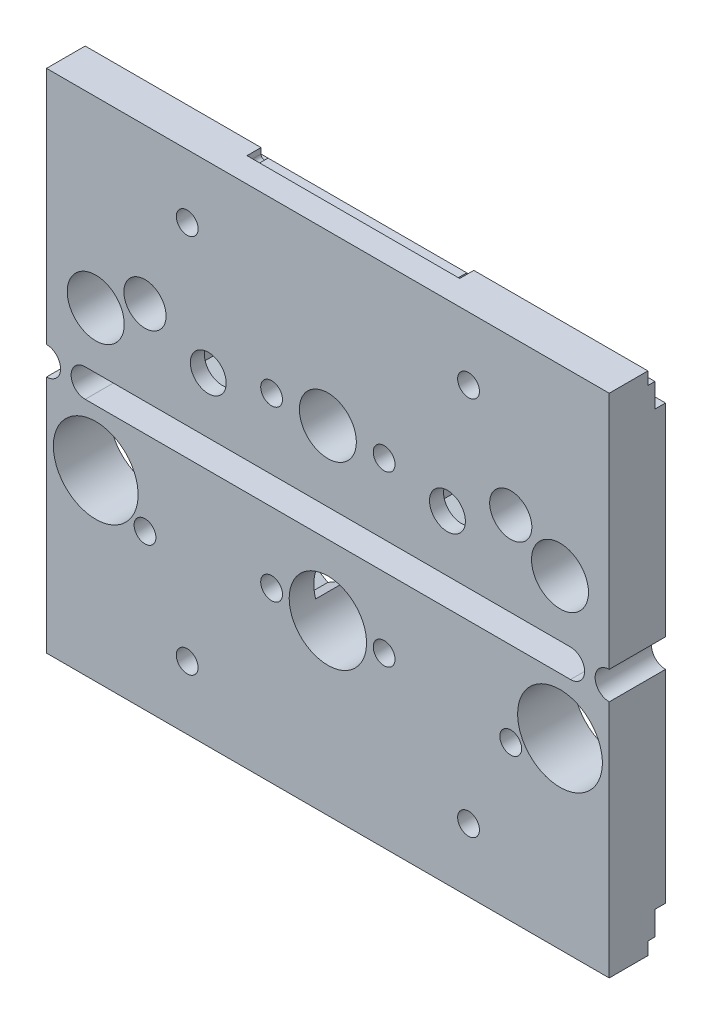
ISO-10303-21;
HEADER;
FILE_DESCRIPTION(('STEP AP214'),'2;1');
FILE_NAME('part.step','',(''),(''),'','','');
FILE_SCHEMA(('AUTOMOTIVE_DESIGN { 1 0 10303 214 1 1 1 1 }'));
ENDSEC;
DATA;
#1=APPLICATION_CONTEXT('core data for automotive mechanical design processes');
#2=APPLICATION_PROTOCOL_DEFINITION('international standard','automotive_design',2000,#1);
#3=PRODUCT_CONTEXT('',#1,'mechanical');
#4=PRODUCT('Part','Part','',(#3));
#5=PRODUCT_RELATED_PRODUCT_CATEGORY('part','',(#4));
#6=PRODUCT_DEFINITION_FORMATION('','',#4);
#7=PRODUCT_DEFINITION_CONTEXT('part definition',#1,'design');
#8=PRODUCT_DEFINITION('design','',#6,#7);
#9=PRODUCT_DEFINITION_SHAPE('','',#8);
#10=(LENGTH_UNIT() NAMED_UNIT(*) SI_UNIT(.MILLI.,.METRE.));
#11=(NAMED_UNIT(*) PLANE_ANGLE_UNIT() SI_UNIT($,.RADIAN.));
#12=(NAMED_UNIT(*) SI_UNIT($,.STERADIAN.) SOLID_ANGLE_UNIT());
#13=UNCERTAINTY_MEASURE_WITH_UNIT(LENGTH_MEASURE(1.E-05),#10,'distance_accuracy_value','');
#14=(GEOMETRIC_REPRESENTATION_CONTEXT(3) GLOBAL_UNCERTAINTY_ASSIGNED_CONTEXT((#13)) GLOBAL_UNIT_ASSIGNED_CONTEXT((#10,
#11,#12)) REPRESENTATION_CONTEXT('',''));
#15=CARTESIAN_POINT('',(0.,0.,0.));
#16=DIRECTION('',(0.,0.,1.));
#17=DIRECTION('',(1.,0.,0.));
#18=AXIS2_PLACEMENT_3D('',#15,#16,#17);
#19=CARTESIAN_POINT('',(57.,8.,0.));
#20=DIRECTION('',(0.,0.,1.));
#21=DIRECTION('',(1.,0.,0.));
#22=AXIS2_PLACEMENT_3D('',#19,#20,#21);
#23=CYLINDRICAL_SURFACE('',#22,2.55);
#24=CARTESIAN_POINT('',(57.,8.,8.));
#25=DIRECTION('',(0.,0.,1.));
#26=DIRECTION('',(1.,0.,0.));
#27=AXIS2_PLACEMENT_3D('',#24,#25,#26);
#28=CIRCLE('',#27,2.55);
#29=CARTESIAN_POINT('',(59.55,8.,8.));
#30=VERTEX_POINT('',#29);
#31=EDGE_CURVE('E924',#30,#30,#28,.T.);
#32=ORIENTED_EDGE('',*,*,#31,.T.);
#33=EDGE_LOOP('',(#32));
#34=FACE_BOUND('',#33,.T.);
#35=CARTESIAN_POINT('',(57.,8.,6.));
#36=DIRECTION('',(0.,0.,-1.));
#37=DIRECTION('',(-1.,0.,0.));
#38=AXIS2_PLACEMENT_3D('',#35,#36,#37);
#39=CIRCLE('',#38,2.55);
#40=CARTESIAN_POINT('',(54.45,8.,6.));
#41=VERTEX_POINT('',#40);
#42=EDGE_CURVE('E1023',#41,#41,#39,.F.);
#43=ORIENTED_EDGE('',*,*,#42,.F.);
#44=EDGE_LOOP('',(#43));
#45=FACE_BOUND('',#44,.T.);
#46=ADVANCED_FACE('F37',(#34,#45),#23,.F.);
#47=CARTESIAN_POINT('',(23.,8.,0.));
#48=DIRECTION('',(0.,0.,1.));
#49=DIRECTION('',(1.,0.,0.));
#50=AXIS2_PLACEMENT_3D('',#47,#48,#49);
#51=CYLINDRICAL_SURFACE('',#50,2.55);
#52=CARTESIAN_POINT('',(23.,8.,8.));
#53=DIRECTION('',(0.,0.,1.));
#54=DIRECTION('',(1.,0.,0.));
#55=AXIS2_PLACEMENT_3D('',#52,#53,#54);
#56=CIRCLE('',#55,2.55);
#57=CARTESIAN_POINT('',(25.55,8.,8.));
#58=VERTEX_POINT('',#57);
#59=EDGE_CURVE('E938',#58,#58,#56,.T.);
#60=ORIENTED_EDGE('',*,*,#59,.T.);
#61=EDGE_LOOP('',(#60));
#62=FACE_BOUND('',#61,.T.);
#63=CARTESIAN_POINT('',(23.,8.,6.));
#64=DIRECTION('',(0.,0.,-1.));
#65=DIRECTION('',(-1.,0.,0.));
#66=AXIS2_PLACEMENT_3D('',#63,#64,#65);
#67=CIRCLE('',#66,2.55);
#68=CARTESIAN_POINT('',(20.45,8.,6.));
#69=VERTEX_POINT('',#68);
#70=EDGE_CURVE('E1020',#69,#69,#67,.F.);
#71=ORIENTED_EDGE('',*,*,#70,.F.);
#72=EDGE_LOOP('',(#71));
#73=FACE_BOUND('',#72,.T.);
#74=ADVANCED_FACE('F1425',(#62,#73),#51,.F.);
#75=CARTESIAN_POINT('',(80.,-38.,8.));
#76=DIRECTION('',(0.,-1.,0.));
#77=DIRECTION('',(1.,0.,0.));
#78=AXIS2_PLACEMENT_3D('',#75,#76,#77);
#79=PLANE('',#78);
#80=DIRECTION('',(1.,0.,0.));
#81=VECTOR('',#80,1.);
#82=CARTESIAN_POINT('',(-4.8988590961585E-11,-38.,2.5));
#83=LINE('',#82,#81);
#84=CARTESIAN_POINT('',(-4.8988590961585E-11,-38.,2.5));
#85=VERTEX_POINT('',#84);
#86=CARTESIAN_POINT('',(25.000000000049,-38.,2.49999999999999));
#87=VERTEX_POINT('',#86);
#88=EDGE_CURVE('E566',#85,#87,#83,.T.);
#89=ORIENTED_EDGE('',*,*,#88,.T.);
#90=DIRECTION('',(0.,0.,-1.));
#91=VECTOR('',#90,1.);
#92=CARTESIAN_POINT('',(25.000000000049,-38.,4.49999999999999));
#93=LINE('',#92,#91);
#94=CARTESIAN_POINT('',(25.000000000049,-38.,4.49999999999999));
#95=VERTEX_POINT('',#94);
#96=EDGE_CURVE('E1109',#95,#87,#93,.T.);
#97=ORIENTED_EDGE('',*,*,#96,.F.);
#98=DIRECTION('',(1.,0.,0.));
#99=VECTOR('',#98,1.);
#100=CARTESIAN_POINT('',(25.000000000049,-38.,4.49999999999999));
#101=LINE('',#100,#99);
#102=CARTESIAN_POINT('',(55.247938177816,-38.,4.49999999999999));
#103=VERTEX_POINT('',#102);
#104=EDGE_CURVE('E1086',#95,#103,#101,.T.);
#105=ORIENTED_EDGE('',*,*,#104,.T.);
#106=DIRECTION('',(0.,0.,-1.));
#107=VECTOR('',#106,1.);
#108=CARTESIAN_POINT('',(55.247938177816,-38.,4.49999999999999));
#109=LINE('',#108,#107);
#110=CARTESIAN_POINT('',(55.247938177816,-38.,2.49999999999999));
#111=VERTEX_POINT('',#110);
#112=EDGE_CURVE('E1113',#103,#111,#109,.T.);
#113=ORIENTED_EDGE('',*,*,#112,.T.);
#114=CARTESIAN_POINT('',(80.,-38.,2.5));
#115=VERTEX_POINT('',#114);
#116=EDGE_CURVE('E571',#111,#115,#83,.T.);
#117=ORIENTED_EDGE('',*,*,#116,.T.);
#118=DIRECTION('',(0.,0.,-1.));
#119=VECTOR('',#118,1.);
#120=CARTESIAN_POINT('',(80.,-38.,8.));
#121=LINE('',#120,#119);
#122=CARTESIAN_POINT('',(80.,-38.,8.));
#123=VERTEX_POINT('',#122);
#124=EDGE_CURVE('E598',#123,#115,#121,.T.);
#125=ORIENTED_EDGE('',*,*,#124,.F.);
#126=DIRECTION('',(-1.,0.,0.));
#127=VECTOR('',#126,1.);
#128=CARTESIAN_POINT('',(80.,-38.,8.));
#129=LINE('',#128,#127);
#130=CARTESIAN_POINT('',(0.,-38.,8.));
#131=VERTEX_POINT('',#130);
#132=EDGE_CURVE('E586',#123,#131,#129,.T.);
#133=ORIENTED_EDGE('',*,*,#132,.T.);
#134=DIRECTION('',(0.,0.,-1.));
#135=VECTOR('',#134,1.);
#136=CARTESIAN_POINT('',(0.,-38.,8.));
#137=LINE('',#136,#135);
#138=EDGE_CURVE('E611',#131,#85,#137,.T.);
#139=ORIENTED_EDGE('',*,*,#138,.T.);
#140=EDGE_LOOP('',(#89,#97,#105,#113,#117,#125,#133,#139));
#141=FACE_BOUND('',#140,.T.);
#142=ADVANCED_FACE('F1394',(#141),#79,.T.);
#143=CARTESIAN_POINT('',(0.,0.,0.));
#144=DIRECTION('',(0.,0.,1.));
#145=DIRECTION('',(1.,0.,0.));
#146=AXIS2_PLACEMENT_3D('',#143,#144,#145);
#147=PLANE('',#146);
#148=DIRECTION('',(0.,1.,0.));
#149=VECTOR('',#148,1.);
#150=CARTESIAN_POINT('',(52.9,5.63286389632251,0.));
#151=LINE('',#150,#149);
#152=CARTESIAN_POINT('',(52.9,5.63286389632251,0.));
#153=VERTEX_POINT('',#152);
#154=CARTESIAN_POINT('',(52.9,10.3671361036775,0.));
#155=VERTEX_POINT('',#154);
#156=EDGE_CURVE('E1279',#153,#155,#151,.T.);
#157=ORIENTED_EDGE('',*,*,#156,.F.);
#158=DIRECTION('',(-0.866025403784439,0.5,0.));
#159=VECTOR('',#158,1.);
#160=CARTESIAN_POINT('',(57.,3.26572779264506,0.));
#161=LINE('',#160,#159);
#162=CARTESIAN_POINT('',(57.,3.26572779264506,0.));
#163=VERTEX_POINT('',#162);
#164=EDGE_CURVE('E59',#163,#153,#161,.T.);
#165=ORIENTED_EDGE('',*,*,#164,.F.);
#166=DIRECTION('',(-0.866025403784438,-0.5,0.));
#167=VECTOR('',#166,1.);
#168=CARTESIAN_POINT('',(61.1,5.63286389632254,0.));
#169=LINE('',#168,#167);
#170=CARTESIAN_POINT('',(61.1,5.63286389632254,0.));
#171=VERTEX_POINT('',#170);
#172=EDGE_CURVE('E1257',#171,#163,#169,.T.);
#173=ORIENTED_EDGE('',*,*,#172,.F.);
#174=DIRECTION('',(0.,-1.,0.));
#175=VECTOR('',#174,1.);
#176=CARTESIAN_POINT('',(61.1,10.3671361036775,0.));
#177=LINE('',#176,#175);
#178=CARTESIAN_POINT('',(61.1,10.3671361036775,0.));
#179=VERTEX_POINT('',#178);
#180=EDGE_CURVE('E1292',#179,#171,#177,.T.);
#181=ORIENTED_EDGE('',*,*,#180,.F.);
#182=DIRECTION('',(0.866025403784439,-0.5,0.));
#183=VECTOR('',#182,1.);
#184=CARTESIAN_POINT('',(57.,12.7342722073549,0.));
#185=LINE('',#184,#183);
#186=CARTESIAN_POINT('',(57.,12.7342722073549,0.));
#187=VERTEX_POINT('',#186);
#188=EDGE_CURVE('E1288',#187,#179,#185,.T.);
#189=ORIENTED_EDGE('',*,*,#188,.F.);
#190=DIRECTION('',(0.866025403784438,0.5,0.));
#191=VECTOR('',#190,1.);
#192=CARTESIAN_POINT('',(52.9,10.3671361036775,0.));
#193=LINE('',#192,#191);
#194=EDGE_CURVE('E1284',#155,#187,#193,.T.);
#195=ORIENTED_EDGE('',*,*,#194,.F.);
#196=EDGE_LOOP('',(#157,#165,#173,#181,#189,#195));
#197=FACE_BOUND('',#196,.T.);
#198=DIRECTION('',(0.,1.,0.));
#199=VECTOR('',#198,1.);
#200=CARTESIAN_POINT('',(18.9,5.63286389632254,0.));
#201=LINE('',#200,#199);
#202=CARTESIAN_POINT('',(18.9,5.63286389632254,0.));
#203=VERTEX_POINT('',#202);
#204=CARTESIAN_POINT('',(18.9,10.3671361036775,0.));
#205=VERTEX_POINT('',#204);
#206=EDGE_CURVE('E1247',#203,#205,#201,.T.);
#207=ORIENTED_EDGE('',*,*,#206,.F.);
#208=DIRECTION('',(-0.866025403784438,0.5,0.));
#209=VECTOR('',#208,1.);
#210=CARTESIAN_POINT('',(23.,3.26572779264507,0.));
#211=LINE('',#210,#209);
#212=CARTESIAN_POINT('',(23.,3.26572779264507,0.));
#213=VERTEX_POINT('',#212);
#214=EDGE_CURVE('E1244',#213,#203,#211,.T.);
#215=ORIENTED_EDGE('',*,*,#214,.F.);
#216=DIRECTION('',(-0.866025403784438,-0.5,0.));
#217=VECTOR('',#216,1.);
#218=CARTESIAN_POINT('',(27.1,5.63286389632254,0.));
#219=LINE('',#218,#217);
#220=CARTESIAN_POINT('',(27.1,5.63286389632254,0.));
#221=VERTEX_POINT('',#220);
#222=EDGE_CURVE('E1319',#221,#213,#219,.T.);
#223=ORIENTED_EDGE('',*,*,#222,.F.);
#224=DIRECTION('',(0.,-1.,0.));
#225=VECTOR('',#224,1.);
#226=CARTESIAN_POINT('',(27.1,10.3671361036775,0.));
#227=LINE('',#226,#225);
#228=CARTESIAN_POINT('',(27.1,10.3671361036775,0.));
#229=VERTEX_POINT('',#228);
#230=EDGE_CURVE('E1351',#229,#221,#227,.T.);
#231=ORIENTED_EDGE('',*,*,#230,.F.);
#232=DIRECTION('',(0.866025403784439,-0.5,0.));
#233=VECTOR('',#232,1.);
#234=CARTESIAN_POINT('',(23.,12.7342722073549,0.));
#235=LINE('',#234,#233);
#236=CARTESIAN_POINT('',(23.,12.7342722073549,0.));
#237=VERTEX_POINT('',#236);
#238=EDGE_CURVE('E1347',#237,#229,#235,.T.);
#239=ORIENTED_EDGE('',*,*,#238,.F.);
#240=DIRECTION('',(0.866025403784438,0.5,0.));
#241=VECTOR('',#240,1.);
#242=CARTESIAN_POINT('',(18.9,10.3671361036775,0.));
#243=LINE('',#242,#241);
#244=EDGE_CURVE('E1343',#205,#237,#243,.T.);
#245=ORIENTED_EDGE('',*,*,#244,.F.);
#246=EDGE_LOOP('',(#207,#215,#223,#231,#239,#245));
#247=FACE_BOUND('',#246,.T.);
#248=CARTESIAN_POINT('',(14.,11.9999999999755,0.));
#249=DIRECTION('',(0.,0.,-1.));
#250=DIRECTION('',(1.,0.,0.));
#251=AXIS2_PLACEMENT_3D('',#248,#249,#250);
#252=CIRCLE('',#251,3.);
#253=CARTESIAN_POINT('',(17.,11.9999999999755,0.));
#254=VERTEX_POINT('',#253);
#255=EDGE_CURVE('E1027',#254,#254,#252,.T.);
#256=ORIENTED_EDGE('',*,*,#255,.F.);
#257=EDGE_LOOP('',(#256));
#258=FACE_BOUND('',#257,.T.);
#259=CARTESIAN_POINT('',(14.,-16.,0.));
#260=DIRECTION('',(0.,0.,-1.));
#261=DIRECTION('',(1.,0.,0.));
#262=AXIS2_PLACEMENT_3D('',#259,#260,#261);
#263=CIRCLE('',#262,1.54999999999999);
#264=CARTESIAN_POINT('',(15.55,-16.,0.));
#265=VERTEX_POINT('',#264);
#266=EDGE_CURVE('E1039',#265,#265,#263,.T.);
#267=ORIENTED_EDGE('',*,*,#266,.F.);
#268=EDGE_LOOP('',(#267));
#269=FACE_BOUND('',#268,.T.);
#270=CARTESIAN_POINT('',(66.,-16.,0.));
#271=DIRECTION('',(0.,0.,-1.));
#272=DIRECTION('',(-1.,0.,0.));
#273=AXIS2_PLACEMENT_3D('',#270,#271,#272);
#274=CIRCLE('',#273,1.54999999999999);
#275=CARTESIAN_POINT('',(64.45,-16.,0.));
#276=VERTEX_POINT('',#275);
#277=EDGE_CURVE('E1378',#276,#276,#274,.T.);
#278=ORIENTED_EDGE('',*,*,#277,.F.);
#279=EDGE_LOOP('',(#278));
#280=FACE_BOUND('',#279,.T.);
#281=CARTESIAN_POINT('',(66.,11.9999999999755,0.));
#282=DIRECTION('',(0.,0.,-1.));
#283=DIRECTION('',(-1.,0.,0.));
#284=AXIS2_PLACEMENT_3D('',#281,#282,#283);
#285=CIRCLE('',#284,3.00000000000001);
#286=CARTESIAN_POINT('',(63.,11.9999999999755,0.));
#287=VERTEX_POINT('',#286);
#288=EDGE_CURVE('E1048',#287,#287,#285,.T.);
#289=ORIENTED_EDGE('',*,*,#288,.F.);
#290=EDGE_LOOP('',(#289));
#291=FACE_BOUND('',#290,.T.);
#292=CARTESIAN_POINT('',(73.,-12.,0.));
#293=DIRECTION('',(0.,0.,-1.));
#294=DIRECTION('',(-1.,0.,0.));
#295=AXIS2_PLACEMENT_3D('',#292,#293,#294);
#296=CIRCLE('',#295,6.025);
#297=CARTESIAN_POINT('',(66.975,-12.,0.));
#298=VERTEX_POINT('',#297);
#299=EDGE_CURVE('E1058',#298,#298,#296,.T.);
#300=ORIENTED_EDGE('',*,*,#299,.F.);
#301=EDGE_LOOP('',(#300));
#302=FACE_BOUND('',#301,.T.);
#303=CARTESIAN_POINT('',(7.,-12.,0.));
#304=DIRECTION('',(0.,0.,-1.));
#305=DIRECTION('',(-1.,0.,0.));
#306=AXIS2_PLACEMENT_3D('',#303,#304,#305);
#307=CIRCLE('',#306,6.025);
#308=CARTESIAN_POINT('',(0.975000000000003,-12.,0.));
#309=VERTEX_POINT('',#308);
#310=EDGE_CURVE('E1047',#309,#309,#307,.T.);
#311=ORIENTED_EDGE('',*,*,#310,.F.);
#312=EDGE_LOOP('',(#311));
#313=FACE_BOUND('',#312,.T.);
#314=CARTESIAN_POINT('',(60.,-29.,0.));
#315=DIRECTION('',(0.,0.,1.));
#316=DIRECTION('',(-1.,0.,0.));
#317=AXIS2_PLACEMENT_3D('',#314,#315,#316);
#318=CIRCLE('',#317,1.55);
#319=CARTESIAN_POINT('',(58.45,-29.,0.));
#320=VERTEX_POINT('',#319);
#321=EDGE_CURVE('E499',#320,#320,#318,.T.);
#322=ORIENTED_EDGE('',*,*,#321,.T.);
#323=EDGE_LOOP('',(#322));
#324=FACE_BOUND('',#323,.T.);
#325=CARTESIAN_POINT('',(19.9999999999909,-29.0000000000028,0.));
#326=DIRECTION('',(0.,0.,1.));
#327=DIRECTION('',(-1.,0.,0.));
#328=AXIS2_PLACEMENT_3D('',#325,#326,#327);
#329=CIRCLE('',#328,1.55);
#330=CARTESIAN_POINT('',(18.4499999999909,-29.0000000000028,0.));
#331=VERTEX_POINT('',#330);
#332=EDGE_CURVE('E1112',#331,#331,#329,.T.);
#333=ORIENTED_EDGE('',*,*,#332,.T.);
#334=EDGE_LOOP('',(#333));
#335=FACE_BOUND('',#334,.T.);
#336=DIRECTION('',(-0.866025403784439,-0.5,0.));
#337=VECTOR('',#336,1.);
#338=CARTESIAN_POINT('',(48.,-10.7091034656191,0.));
#339=LINE('',#338,#337);
#340=CARTESIAN_POINT('',(48.,-10.7091034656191,0.));
#341=VERTEX_POINT('',#340);
#342=CARTESIAN_POINT('',(45.2328562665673,-12.3067146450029,0.));
#343=VERTEX_POINT('',#342);
#344=EDGE_CURVE('E479',#341,#343,#339,.T.);
#345=ORIENTED_EDGE('',*,*,#344,.T.);
#346=CARTESIAN_POINT('',(40.,-14.,0.));
#347=DIRECTION('',(0.,0.,-1.));
#348=DIRECTION('',(-1.,0.,0.));
#349=AXIS2_PLACEMENT_3D('',#346,#347,#348);
#350=CIRCLE('',#349,5.5);
#351=CARTESIAN_POINT('',(34.7671437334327,-12.3067146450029,0.));
#352=VERTEX_POINT('',#351);
#353=EDGE_CURVE('E463',#352,#343,#350,.T.);
#354=ORIENTED_EDGE('',*,*,#353,.F.);
#355=DIRECTION('',(-0.866025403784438,0.5,0.));
#356=VECTOR('',#355,1.);
#357=CARTESIAN_POINT('',(34.85,-12.3545517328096,0.));
#358=LINE('',#357,#356);
#359=CARTESIAN_POINT('',(32.,-10.7091034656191,0.));
#360=VERTEX_POINT('',#359);
#361=EDGE_CURVE('E475',#352,#360,#358,.T.);
#362=ORIENTED_EDGE('',*,*,#361,.T.);
#363=DIRECTION('',(-0.866025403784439,-0.499999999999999,0.));
#364=VECTOR('',#363,1.);
#365=CARTESIAN_POINT('',(32.,-10.7091034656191,0.));
#366=LINE('',#365,#364);
#367=CARTESIAN_POINT('',(29.15,-12.3545517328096,0.));
#368=VERTEX_POINT('',#367);
#369=EDGE_CURVE('E512',#360,#368,#366,.T.);
#370=ORIENTED_EDGE('',*,*,#369,.T.);
#371=DIRECTION('',(0.,-1.,0.));
#372=VECTOR('',#371,1.);
#373=CARTESIAN_POINT('',(29.15,-12.3545517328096,0.));
#374=LINE('',#373,#372);
#375=CARTESIAN_POINT('',(29.15,-15.6454482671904,0.));
#376=VERTEX_POINT('',#375);
#377=EDGE_CURVE('E508',#368,#376,#374,.T.);
#378=ORIENTED_EDGE('',*,*,#377,.T.);
#379=DIRECTION('',(0.866025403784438,-0.500000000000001,0.));
#380=VECTOR('',#379,1.);
#381=CARTESIAN_POINT('',(29.15,-15.6454482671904,0.));
#382=LINE('',#381,#380);
#383=CARTESIAN_POINT('',(32.,-17.2908965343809,0.));
#384=VERTEX_POINT('',#383);
#385=EDGE_CURVE('E495',#376,#384,#382,.T.);
#386=ORIENTED_EDGE('',*,*,#385,.T.);
#387=DIRECTION('',(0.866025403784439,0.499999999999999,0.));
#388=VECTOR('',#387,1.);
#389=CARTESIAN_POINT('',(32.,-17.2908965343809,0.));
#390=LINE('',#389,#388);
#391=CARTESIAN_POINT('',(34.7671437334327,-15.6932853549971,0.));
#392=VERTEX_POINT('',#391);
#393=EDGE_CURVE('E488',#384,#392,#390,.T.);
#394=ORIENTED_EDGE('',*,*,#393,.T.);
#395=CARTESIAN_POINT('',(45.2328562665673,-15.6932853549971,0.));
#396=VERTEX_POINT('',#395);
#397=EDGE_CURVE('E481',#396,#392,#350,.T.);
#398=ORIENTED_EDGE('',*,*,#397,.F.);
#399=DIRECTION('',(0.866025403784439,-0.5,0.));
#400=VECTOR('',#399,1.);
#401=CARTESIAN_POINT('',(45.15,-15.6454482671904,0.));
#402=LINE('',#401,#400);
#403=CARTESIAN_POINT('',(48.,-17.2908965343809,0.));
#404=VERTEX_POINT('',#403);
#405=EDGE_CURVE('E1159',#396,#404,#402,.T.);
#406=ORIENTED_EDGE('',*,*,#405,.T.);
#407=DIRECTION('',(0.866025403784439,0.5,0.));
#408=VECTOR('',#407,1.);
#409=CARTESIAN_POINT('',(48.,-17.2908965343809,0.));
#410=LINE('',#409,#408);
#411=CARTESIAN_POINT('',(50.85,-15.6454482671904,0.));
#412=VERTEX_POINT('',#411);
#413=EDGE_CURVE('E518',#404,#412,#410,.T.);
#414=ORIENTED_EDGE('',*,*,#413,.T.);
#415=DIRECTION('',(0.,1.,0.));
#416=VECTOR('',#415,1.);
#417=CARTESIAN_POINT('',(50.85,-15.6454482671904,0.));
#418=LINE('',#417,#416);
#419=CARTESIAN_POINT('',(50.85,-12.3545517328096,0.));
#420=VERTEX_POINT('',#419);
#421=EDGE_CURVE('E1143',#412,#420,#418,.T.);
#422=ORIENTED_EDGE('',*,*,#421,.T.);
#423=DIRECTION('',(-0.866025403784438,0.5,0.));
#424=VECTOR('',#423,1.);
#425=CARTESIAN_POINT('',(50.85,-12.3545517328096,0.));
#426=LINE('',#425,#424);
#427=EDGE_CURVE('E1164',#420,#341,#426,.T.);
#428=ORIENTED_EDGE('',*,*,#427,.T.);
#429=EDGE_LOOP('',(#345,#354,#362,#370,#378,#386,#394,#398,#406,#414,#422,#428));
#430=FACE_BOUND('',#429,.T.);
#431=CARTESIAN_POINT('',(73.,8.,0.));
#432=DIRECTION('',(0.,0.,1.));
#433=DIRECTION('',(1.,0.,0.));
#434=AXIS2_PLACEMENT_3D('',#431,#432,#433);
#435=CIRCLE('',#434,4.05);
#436=CARTESIAN_POINT('',(77.05,8.,0.));
#437=VERTEX_POINT('',#436);
#438=EDGE_CURVE('E942',#437,#437,#435,.T.);
#439=ORIENTED_EDGE('',*,*,#438,.T.);
#440=EDGE_LOOP('',(#439));
#441=FACE_BOUND('',#440,.T.);
#442=CARTESIAN_POINT('',(40.,10.,0.));
#443=DIRECTION('',(0.,0.,1.));
#444=DIRECTION('',(1.,0.,0.));
#445=AXIS2_PLACEMENT_3D('',#442,#443,#444);
#446=CIRCLE('',#445,4.05);
#447=CARTESIAN_POINT('',(44.05,10.,0.));
#448=VERTEX_POINT('',#447);
#449=EDGE_CURVE('E950',#448,#448,#446,.T.);
#450=ORIENTED_EDGE('',*,*,#449,.T.);
#451=EDGE_LOOP('',(#450));
#452=FACE_BOUND('',#451,.T.);
#453=CARTESIAN_POINT('',(7.,8.,0.));
#454=DIRECTION('',(0.,0.,1.));
#455=DIRECTION('',(1.,0.,0.));
#456=AXIS2_PLACEMENT_3D('',#453,#454,#455);
#457=CIRCLE('',#456,4.05);
#458=CARTESIAN_POINT('',(11.05,8.,0.));
#459=VERTEX_POINT('',#458);
#460=EDGE_CURVE('E958',#459,#459,#457,.T.);
#461=ORIENTED_EDGE('',*,*,#460,.T.);
#462=EDGE_LOOP('',(#461));
#463=FACE_BOUND('',#462,.T.);
#464=DIRECTION('',(1.,0.,0.));
#465=VECTOR('',#464,1.);
#466=CARTESIAN_POINT('',(0.,-4.,0.));
#467=LINE('',#466,#465);
#468=CARTESIAN_POINT('',(5.49999999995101,-4.,0.));
#469=VERTEX_POINT('',#468);
#470=CARTESIAN_POINT('',(74.5,-4.,0.));
#471=VERTEX_POINT('',#470);
#472=EDGE_CURVE('E587',#469,#471,#467,.T.);
#473=ORIENTED_EDGE('',*,*,#472,.T.);
#474=CARTESIAN_POINT('',(74.5,-2.00000000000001,0.));
#475=DIRECTION('',(0.,0.,-1.));
#476=DIRECTION('',(1.,0.,0.));
#477=AXIS2_PLACEMENT_3D('',#474,#475,#476);
#478=CIRCLE('',#477,2.00000000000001);
#479=CARTESIAN_POINT('',(74.5,0.,0.));
#480=VERTEX_POINT('',#479);
#481=EDGE_CURVE('E646',#480,#471,#478,.T.);
#482=ORIENTED_EDGE('',*,*,#481,.F.);
#483=DIRECTION('',(1.,0.,0.));
#484=VECTOR('',#483,1.);
#485=CARTESIAN_POINT('',(0.,0.,0.));
#486=LINE('',#485,#484);
#487=CARTESIAN_POINT('',(5.49999999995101,0.,0.));
#488=VERTEX_POINT('',#487);
#489=EDGE_CURVE('E986',#488,#480,#486,.T.);
#490=ORIENTED_EDGE('',*,*,#489,.F.);
#491=CARTESIAN_POINT('',(5.49999999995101,-2.00000000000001,0.));
#492=DIRECTION('',(0.,0.,-1.));
#493=DIRECTION('',(1.,0.,0.));
#494=AXIS2_PLACEMENT_3D('',#491,#492,#493);
#495=CIRCLE('',#494,2.);
#496=EDGE_CURVE('E616',#469,#488,#495,.T.);
#497=ORIENTED_EDGE('',*,*,#496,.F.);
#498=EDGE_LOOP('',(#473,#482,#490,#497));
#499=FACE_BOUND('',#498,.T.);
#500=DIRECTION('',(-0.866025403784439,0.499999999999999,0.));
#501=VECTOR('',#500,1.);
#502=CARTESIAN_POINT('',(32.,6.70910346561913,0.));
#503=LINE('',#502,#501);
#504=CARTESIAN_POINT('',(32.,6.70910346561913,0.));
#505=VERTEX_POINT('',#504);
#506=CARTESIAN_POINT('',(29.15,8.35455173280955,0.));
#507=VERTEX_POINT('',#506);
#508=EDGE_CURVE('E851',#505,#507,#503,.T.);
#509=ORIENTED_EDGE('',*,*,#508,.F.);
#510=DIRECTION('',(-0.866025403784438,-0.5,0.));
#511=VECTOR('',#510,1.);
#512=CARTESIAN_POINT('',(34.85,8.35455173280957,0.));
#513=LINE('',#512,#511);
#514=CARTESIAN_POINT('',(34.85,8.35455173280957,0.));
#515=VERTEX_POINT('',#514);
#516=EDGE_CURVE('E777',#515,#505,#513,.T.);
#517=ORIENTED_EDGE('',*,*,#516,.F.);
#518=DIRECTION('',(0.,-1.,0.));
#519=VECTOR('',#518,1.);
#520=CARTESIAN_POINT('',(34.85,11.6454482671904,0.));
#521=LINE('',#520,#519);
#522=CARTESIAN_POINT('',(34.85,11.6454482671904,0.));
#523=VERTEX_POINT('',#522);
#524=EDGE_CURVE('E834',#523,#515,#521,.T.);
#525=ORIENTED_EDGE('',*,*,#524,.F.);
#526=DIRECTION('',(0.866025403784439,-0.499999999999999,0.));
#527=VECTOR('',#526,1.);
#528=CARTESIAN_POINT('',(32.,13.2908965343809,0.));
#529=LINE('',#528,#527);
#530=CARTESIAN_POINT('',(32.,13.2908965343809,0.));
#531=VERTEX_POINT('',#530);
#532=EDGE_CURVE('E838',#531,#523,#529,.T.);
#533=ORIENTED_EDGE('',*,*,#532,.F.);
#534=DIRECTION('',(0.866025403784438,0.500000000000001,0.));
#535=VECTOR('',#534,1.);
#536=CARTESIAN_POINT('',(29.15,11.6454482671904,0.));
#537=LINE('',#536,#535);
#538=CARTESIAN_POINT('',(29.15,11.6454482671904,0.));
#539=VERTEX_POINT('',#538);
#540=EDGE_CURVE('E843',#539,#531,#537,.T.);
#541=ORIENTED_EDGE('',*,*,#540,.F.);
#542=DIRECTION('',(0.,1.,0.));
#543=VECTOR('',#542,1.);
#544=CARTESIAN_POINT('',(29.15,8.35455173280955,0.));
#545=LINE('',#544,#543);
#546=EDGE_CURVE('E847',#507,#539,#545,.T.);
#547=ORIENTED_EDGE('',*,*,#546,.F.);
#548=EDGE_LOOP('',(#509,#517,#525,#533,#541,#547));
#549=FACE_BOUND('',#548,.T.);
#550=DIRECTION('',(0.,-1.,0.));
#551=VECTOR('',#550,1.);
#552=CARTESIAN_POINT('',(50.85,11.6454482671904,0.));
#553=LINE('',#552,#551);
#554=CARTESIAN_POINT('',(50.85,11.6454482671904,0.));
#555=VERTEX_POINT('',#554);
#556=CARTESIAN_POINT('',(50.85,8.35455173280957,0.));
#557=VERTEX_POINT('',#556);
#558=EDGE_CURVE('E776',#555,#557,#553,.T.);
#559=ORIENTED_EDGE('',*,*,#558,.F.);
#560=DIRECTION('',(0.866025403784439,-0.5,0.));
#561=VECTOR('',#560,1.);
#562=CARTESIAN_POINT('',(48.,13.2908965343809,0.));
#563=LINE('',#562,#561);
#564=CARTESIAN_POINT('',(48.,13.2908965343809,0.));
#565=VERTEX_POINT('',#564);
#566=EDGE_CURVE('E773',#565,#555,#563,.T.);
#567=ORIENTED_EDGE('',*,*,#566,.F.);
#568=DIRECTION('',(0.866025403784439,0.5,0.));
#569=VECTOR('',#568,1.);
#570=CARTESIAN_POINT('',(45.15,11.6454482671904,0.));
#571=LINE('',#570,#569);
#572=CARTESIAN_POINT('',(45.15,11.6454482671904,0.));
#573=VERTEX_POINT('',#572);
#574=EDGE_CURVE('E752',#573,#565,#571,.T.);
#575=ORIENTED_EDGE('',*,*,#574,.F.);
#576=DIRECTION('',(0.,1.,0.));
#577=VECTOR('',#576,1.);
#578=CARTESIAN_POINT('',(45.15,8.35455173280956,0.));
#579=LINE('',#578,#577);
#580=CARTESIAN_POINT('',(45.15,8.35455173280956,0.));
#581=VERTEX_POINT('',#580);
#582=EDGE_CURVE('E789',#581,#573,#579,.T.);
#583=ORIENTED_EDGE('',*,*,#582,.F.);
#584=DIRECTION('',(-0.866025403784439,0.5,0.));
#585=VECTOR('',#584,1.);
#586=CARTESIAN_POINT('',(48.,6.70910346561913,0.));
#587=LINE('',#586,#585);
#588=CARTESIAN_POINT('',(48.,6.70910346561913,0.));
#589=VERTEX_POINT('',#588);
#590=EDGE_CURVE('E785',#589,#581,#587,.T.);
#591=ORIENTED_EDGE('',*,*,#590,.F.);
#592=DIRECTION('',(-0.866025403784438,-0.5,0.));
#593=VECTOR('',#592,1.);
#594=CARTESIAN_POINT('',(50.85,8.35455173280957,0.));
#595=LINE('',#594,#593);
#596=EDGE_CURVE('E781',#557,#589,#595,.T.);
#597=ORIENTED_EDGE('',*,*,#596,.F.);
#598=EDGE_LOOP('',(#559,#567,#575,#583,#591,#597));
#599=FACE_BOUND('',#598,.T.);
#600=CARTESIAN_POINT('',(19.9999999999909,25.0000000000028,0.));
#601=DIRECTION('',(0.,0.,-1.));
#602=DIRECTION('',(-1.,0.,0.));
#603=AXIS2_PLACEMENT_3D('',#600,#601,#602);
#604=CIRCLE('',#603,1.55);
#605=CARTESIAN_POINT('',(18.4499999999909,25.0000000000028,0.));
#606=VERTEX_POINT('',#605);
#607=EDGE_CURVE('E715',#606,#606,#604,.T.);
#608=ORIENTED_EDGE('',*,*,#607,.F.);
#609=EDGE_LOOP('',(#608));
#610=FACE_BOUND('',#609,.T.);
#611=CARTESIAN_POINT('',(60.,25.,0.));
#612=DIRECTION('',(0.,0.,-1.));
#613=DIRECTION('',(-1.,0.,0.));
#614=AXIS2_PLACEMENT_3D('',#611,#612,#613);
#615=CIRCLE('',#614,1.55);
#616=CARTESIAN_POINT('',(58.45,25.,0.));
#617=VERTEX_POINT('',#616);
#618=EDGE_CURVE('E736',#617,#617,#615,.T.);
#619=ORIENTED_EDGE('',*,*,#618,.F.);
#620=EDGE_LOOP('',(#619));
#621=FACE_BOUND('',#620,.T.);
#622=DIRECTION('',(1.,0.,0.));
#623=VECTOR('',#622,1.);
#624=CARTESIAN_POINT('',(-4.8988590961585E-11,-32.7999999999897,0.));
#625=LINE('',#624,#623);
#626=CARTESIAN_POINT('',(-4.8988590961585E-11,-32.7999999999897,0.));
#627=VERTEX_POINT('',#626);
#628=CARTESIAN_POINT('',(80.,-32.7999999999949,0.));
#629=VERTEX_POINT('',#628);
#630=EDGE_CURVE('E551',#627,#629,#625,.T.);
#631=ORIENTED_EDGE('',*,*,#630,.F.);
#632=DIRECTION('',(0.,1.,0.));
#633=VECTOR('',#632,1.);
#634=CARTESIAN_POINT('',(0.,-38.,0.));
#635=LINE('',#634,#633);
#636=CARTESIAN_POINT('',(0.,-4.,0.));
#637=VERTEX_POINT('',#636);
#638=EDGE_CURVE('E570',#627,#637,#635,.T.);
#639=ORIENTED_EDGE('',*,*,#638,.T.);
#640=CARTESIAN_POINT('',(-4.89859888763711E-11,-2.00000000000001,0.));
#641=DIRECTION('',(0.,0.,-1.));
#642=DIRECTION('',(1.,0.,0.));
#643=AXIS2_PLACEMENT_3D('',#640,#641,#642);
#644=CIRCLE('',#643,2.);
#645=CARTESIAN_POINT('',(-4.89858664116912E-11,0.,0.));
#646=VERTEX_POINT('',#645);
#647=EDGE_CURVE('E620',#646,#637,#644,.T.);
#648=ORIENTED_EDGE('',*,*,#647,.F.);
#649=DIRECTION('',(0.,-1.,0.));
#650=VECTOR('',#649,1.);
#651=CARTESIAN_POINT('',(0.,34.,0.));
#652=LINE('',#651,#650);
#653=CARTESIAN_POINT('',(0.,28.7999999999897,0.));
#654=VERTEX_POINT('',#653);
#655=EDGE_CURVE('E966',#654,#646,#652,.T.);
#656=ORIENTED_EDGE('',*,*,#655,.F.);
#657=DIRECTION('',(1.,0.,0.));
#658=VECTOR('',#657,1.);
#659=CARTESIAN_POINT('',(0.,28.7999999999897,0.));
#660=LINE('',#659,#658);
#661=CARTESIAN_POINT('',(80.,28.7999999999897,0.));
#662=VERTEX_POINT('',#661);
#663=EDGE_CURVE('E920',#654,#662,#660,.T.);
#664=ORIENTED_EDGE('',*,*,#663,.T.);
#665=DIRECTION('',(0.,1.,0.));
#666=VECTOR('',#665,1.);
#667=CARTESIAN_POINT('',(80.,0.,0.));
#668=LINE('',#667,#666);
#669=CARTESIAN_POINT('',(80.,0.,0.));
#670=VERTEX_POINT('',#669);
#671=EDGE_CURVE('E974',#670,#662,#668,.T.);
#672=ORIENTED_EDGE('',*,*,#671,.F.);
#673=CARTESIAN_POINT('',(80.,-2.,0.));
#674=DIRECTION('',(0.,0.,-1.));
#675=DIRECTION('',(1.,0.,0.));
#676=AXIS2_PLACEMENT_3D('',#673,#674,#675);
#677=CIRCLE('',#676,2.);
#678=CARTESIAN_POINT('',(80.,-4.,0.));
#679=VERTEX_POINT('',#678);
#680=EDGE_CURVE('E643',#679,#670,#677,.T.);
#681=ORIENTED_EDGE('',*,*,#680,.F.);
#682=DIRECTION('',(0.,-1.,0.));
#683=VECTOR('',#682,1.);
#684=CARTESIAN_POINT('',(80.,-4.,0.));
#685=LINE('',#684,#683);
#686=EDGE_CURVE('E601',#679,#629,#685,.T.);
#687=ORIENTED_EDGE('',*,*,#686,.T.);
#688=EDGE_LOOP('',(#631,#639,#648,#656,#664,#672,#681,#687));
#689=FACE_BOUND('',#688,.T.);
#690=ADVANCED_FACE('F472',(#197,#247,#258,#269,#280,#291,#302,#313,#324,#335,#430,#441,#452,
#463,#499,#549,#599,#610,#621,#689),#147,.F.);
#691=CARTESIAN_POINT('',(32.,-14.,0.));
#692=DIRECTION('',(0.,0.,1.));
#693=DIRECTION('',(1.,0.,0.));
#694=AXIS2_PLACEMENT_3D('',#691,#692,#693);
#695=CYLINDRICAL_SURFACE('',#694,1.55);
#696=CARTESIAN_POINT('',(32.,-14.,8.));
#697=DIRECTION('',(0.,0.,-1.));
#698=DIRECTION('',(1.,0.,0.));
#699=AXIS2_PLACEMENT_3D('',#696,#697,#698);
#700=CIRCLE('',#699,1.55);
#701=CARTESIAN_POINT('',(33.55,-14.,8.));
#702=VERTEX_POINT('',#701);
#703=EDGE_CURVE('E533',#702,#702,#700,.T.);
#704=ORIENTED_EDGE('',*,*,#703,.F.);
#705=EDGE_LOOP('',(#704));
#706=FACE_BOUND('',#705,.T.);
#707=CARTESIAN_POINT('',(32.,-14.,4.5));
#708=DIRECTION('',(0.,0.,-1.));
#709=DIRECTION('',(-1.,0.,0.));
#710=AXIS2_PLACEMENT_3D('',#707,#708,#709);
#711=CIRCLE('',#710,1.55);
#712=CARTESIAN_POINT('',(30.45,-14.,4.5));
#713=VERTEX_POINT('',#712);
#714=EDGE_CURVE('E537',#713,#713,#711,.T.);
#715=ORIENTED_EDGE('',*,*,#714,.T.);
#716=EDGE_LOOP('',(#715));
#717=FACE_BOUND('',#716,.T.);
#718=ADVANCED_FACE('F1393',(#706,#717),#695,.F.);
#719=CARTESIAN_POINT('',(48.,-14.,0.));
#720=DIRECTION('',(0.,0.,1.));
#721=DIRECTION('',(1.,0.,0.));
#722=AXIS2_PLACEMENT_3D('',#719,#720,#721);
#723=CYLINDRICAL_SURFACE('',#722,1.55);
#724=CARTESIAN_POINT('',(48.,-14.,8.));
#725=DIRECTION('',(0.,0.,-1.));
#726=DIRECTION('',(1.,0.,0.));
#727=AXIS2_PLACEMENT_3D('',#724,#725,#726);
#728=CIRCLE('',#727,1.55);
#729=CARTESIAN_POINT('',(49.55,-14.,8.));
#730=VERTEX_POINT('',#729);
#731=EDGE_CURVE('E528',#730,#730,#728,.T.);
#732=ORIENTED_EDGE('',*,*,#731,.F.);
#733=EDGE_LOOP('',(#732));
#734=FACE_BOUND('',#733,.T.);
#735=CARTESIAN_POINT('',(48.,-14.,4.5));
#736=DIRECTION('',(0.,0.,-1.));
#737=DIRECTION('',(-1.,0.,0.));
#738=AXIS2_PLACEMENT_3D('',#735,#736,#737);
#739=CIRCLE('',#738,1.55);
#740=CARTESIAN_POINT('',(46.45,-14.,4.5));
#741=VERTEX_POINT('',#740);
#742=EDGE_CURVE('E1012',#741,#741,#739,.T.);
#743=ORIENTED_EDGE('',*,*,#742,.T.);
#744=EDGE_LOOP('',(#743));
#745=FACE_BOUND('',#744,.T.);
#746=ADVANCED_FACE('F1572',(#734,#745),#723,.F.);
#747=CARTESIAN_POINT('',(0.,-38.,8.));
#748=DIRECTION('',(-1.,0.,0.));
#749=DIRECTION('',(0.,0.,1.));
#750=AXIS2_PLACEMENT_3D('',#747,#748,#749);
#751=PLANE('',#750);
#752=DIRECTION('',(0.,0.,-1.));
#753=VECTOR('',#752,1.);
#754=CARTESIAN_POINT('',(-4.8988590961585E-11,-36.2,1.5));
#755=LINE('',#754,#753);
#756=CARTESIAN_POINT('',(-4.8988590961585E-11,-36.2,2.5));
#757=VERTEX_POINT('',#756);
#758=CARTESIAN_POINT('',(-4.8988590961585E-11,-36.2,1.5));
#759=VERTEX_POINT('',#758);
#760=EDGE_CURVE('E545',#757,#759,#755,.T.);
#761=ORIENTED_EDGE('',*,*,#760,.F.);
#762=DIRECTION('',(0.,1.,0.));
#763=VECTOR('',#762,1.);
#764=CARTESIAN_POINT('',(-4.8988590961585E-11,-36.2,2.5));
#765=LINE('',#764,#763);
#766=EDGE_CURVE('E548',#85,#757,#765,.T.);
#767=ORIENTED_EDGE('',*,*,#766,.F.);
#768=ORIENTED_EDGE('',*,*,#138,.F.);
#769=DIRECTION('',(0.,1.,0.));
#770=VECTOR('',#769,1.);
#771=CARTESIAN_POINT('',(0.,-38.,8.));
#772=LINE('',#771,#770);
#773=CARTESIAN_POINT('',(-4.89859888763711E-11,-4.00000000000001,8.));
#774=VERTEX_POINT('',#773);
#775=EDGE_CURVE('E583',#131,#774,#772,.T.);
#776=ORIENTED_EDGE('',*,*,#775,.T.);
#777=DIRECTION('',(0.,0.,1.));
#778=VECTOR('',#777,1.);
#779=CARTESIAN_POINT('',(-4.89859888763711E-11,-4.00000000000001,0.));
#780=LINE('',#779,#778);
#781=EDGE_CURVE('E636',#637,#774,#780,.T.);
#782=ORIENTED_EDGE('',*,*,#781,.F.);
#783=ORIENTED_EDGE('',*,*,#638,.F.);
#784=DIRECTION('',(0.,6.85562717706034E-12,-1.));
#785=VECTOR('',#784,1.);
#786=CARTESIAN_POINT('',(-4.8988590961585E-11,-32.8,1.5));
#787=LINE('',#786,#785);
#788=CARTESIAN_POINT('',(-4.8988590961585E-11,-32.8,1.5));
#789=VERTEX_POINT('',#788);
#790=EDGE_CURVE('E538',#789,#627,#787,.T.);
#791=ORIENTED_EDGE('',*,*,#790,.F.);
#792=DIRECTION('',(0.,1.,0.));
#793=VECTOR('',#792,1.);
#794=CARTESIAN_POINT('',(-4.8988590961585E-11,-36.2,1.5));
#795=LINE('',#794,#793);
#796=EDGE_CURVE('E541',#759,#789,#795,.T.);
#797=ORIENTED_EDGE('',*,*,#796,.F.);
#798=EDGE_LOOP('',(#761,#767,#768,#776,#782,#783,#791,#797));
#799=FACE_BOUND('',#798,.T.);
#800=ADVANCED_FACE('F1472',(#799),#751,.T.);
#801=CARTESIAN_POINT('',(80.,-4.,8.));
#802=DIRECTION('',(1.,0.,0.));
#803=DIRECTION('',(0.,0.,-1.));
#804=AXIS2_PLACEMENT_3D('',#801,#802,#803);
#805=PLANE('',#804);
#806=ORIENTED_EDGE('',*,*,#124,.T.);
#807=DIRECTION('',(0.,1.,0.));
#808=VECTOR('',#807,1.);
#809=CARTESIAN_POINT('',(80.,-36.2,2.5));
#810=LINE('',#809,#808);
#811=CARTESIAN_POINT('',(80.,-36.2,2.5));
#812=VERTEX_POINT('',#811);
#813=EDGE_CURVE('E542',#115,#812,#810,.T.);
#814=ORIENTED_EDGE('',*,*,#813,.T.);
#815=DIRECTION('',(0.,0.,-1.));
#816=VECTOR('',#815,1.);
#817=CARTESIAN_POINT('',(80.,-36.2,1.5));
#818=LINE('',#817,#816);
#819=CARTESIAN_POINT('',(80.,-36.2,1.5));
#820=VERTEX_POINT('',#819);
#821=EDGE_CURVE('E559',#812,#820,#818,.T.);
#822=ORIENTED_EDGE('',*,*,#821,.T.);
#823=DIRECTION('',(0.,1.,0.));
#824=VECTOR('',#823,1.);
#825=CARTESIAN_POINT('',(80.,-36.2,1.5));
#826=LINE('',#825,#824);
#827=CARTESIAN_POINT('',(80.,-32.8,1.5));
#828=VERTEX_POINT('',#827);
#829=EDGE_CURVE('E555',#820,#828,#826,.T.);
#830=ORIENTED_EDGE('',*,*,#829,.T.);
#831=DIRECTION('',(0.,6.85562717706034E-12,-1.));
#832=VECTOR('',#831,1.);
#833=CARTESIAN_POINT('',(80.,-32.8,1.5));
#834=LINE('',#833,#832);
#835=EDGE_CURVE('E532',#828,#629,#834,.T.);
#836=ORIENTED_EDGE('',*,*,#835,.T.);
#837=ORIENTED_EDGE('',*,*,#686,.F.);
#838=DIRECTION('',(0.,0.,1.));
#839=VECTOR('',#838,1.);
#840=CARTESIAN_POINT('',(80.,-4.00000000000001,0.));
#841=LINE('',#840,#839);
#842=CARTESIAN_POINT('',(80.,-4.,8.));
#843=VERTEX_POINT('',#842);
#844=EDGE_CURVE('E658',#679,#843,#841,.T.);
#845=ORIENTED_EDGE('',*,*,#844,.T.);
#846=DIRECTION('',(0.,-1.,0.));
#847=VECTOR('',#846,1.);
#848=CARTESIAN_POINT('',(80.,-4.,8.));
#849=LINE('',#848,#847);
#850=EDGE_CURVE('E591',#843,#123,#849,.T.);
#851=ORIENTED_EDGE('',*,*,#850,.T.);
#852=EDGE_LOOP('',(#806,#814,#822,#830,#836,#837,#845,#851));
#853=FACE_BOUND('',#852,.T.);
#854=ADVANCED_FACE('F1464',(#853),#805,.T.);
#855=CARTESIAN_POINT('',(0.,0.,8.));
#856=DIRECTION('',(0.,1.,0.));
#857=DIRECTION('',(0.,0.,1.));
#858=AXIS2_PLACEMENT_3D('',#855,#856,#857);
#859=PLANE('',#858);
#860=DIRECTION('',(1.,0.,0.));
#861=VECTOR('',#860,1.);
#862=CARTESIAN_POINT('',(0.,0.,8.));
#863=LINE('',#862,#861);
#864=CARTESIAN_POINT('',(5.49999999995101,0.,8.));
#865=VERTEX_POINT('',#864);
#866=CARTESIAN_POINT('',(74.5,0.,8.));
#867=VERTEX_POINT('',#866);
#868=EDGE_CURVE('E973',#865,#867,#863,.T.);
#869=ORIENTED_EDGE('',*,*,#868,.F.);
#870=DIRECTION('',(0.,0.,1.));
#871=VECTOR('',#870,1.);
#872=CARTESIAN_POINT('',(5.49999999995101,0.,0.));
#873=LINE('',#872,#871);
#874=EDGE_CURVE('E625',#488,#865,#873,.T.);
#875=ORIENTED_EDGE('',*,*,#874,.F.);
#876=ORIENTED_EDGE('',*,*,#489,.T.);
#877=DIRECTION('',(0.,0.,1.));
#878=VECTOR('',#877,1.);
#879=CARTESIAN_POINT('',(74.5,0.,0.));
#880=LINE('',#879,#878);
#881=EDGE_CURVE('E651',#480,#867,#880,.T.);
#882=ORIENTED_EDGE('',*,*,#881,.T.);
#883=EDGE_LOOP('',(#869,#875,#876,#882));
#884=FACE_BOUND('',#883,.T.);
#885=ADVANCED_FACE('F1461',(#884),#859,.F.);
#886=CARTESIAN_POINT('',(32.,10.,0.));
#887=DIRECTION('',(0.,0.,1.));
#888=DIRECTION('',(1.,0.,0.));
#889=AXIS2_PLACEMENT_3D('',#886,#887,#888);
#890=CYLINDRICAL_SURFACE('',#889,1.55);
#891=CARTESIAN_POINT('',(32.,10.,8.));
#892=DIRECTION('',(0.,0.,1.));
#893=DIRECTION('',(1.,0.,0.));
#894=AXIS2_PLACEMENT_3D('',#891,#892,#893);
#895=CIRCLE('',#894,1.55);
#896=CARTESIAN_POINT('',(33.55,10.,8.));
#897=VERTEX_POINT('',#896);
#898=EDGE_CURVE('E884',#897,#897,#895,.T.);
#899=ORIENTED_EDGE('',*,*,#898,.T.);
#900=EDGE_LOOP('',(#899));
#901=FACE_BOUND('',#900,.T.);
#902=CARTESIAN_POINT('',(32.,10.,4.5));
#903=DIRECTION('',(0.,0.,-1.));
#904=DIRECTION('',(-1.,0.,0.));
#905=AXIS2_PLACEMENT_3D('',#902,#903,#904);
#906=CIRCLE('',#905,1.55);
#907=CARTESIAN_POINT('',(30.45,10.,4.5));
#908=VERTEX_POINT('',#907);
#909=EDGE_CURVE('E888',#908,#908,#906,.F.);
#910=ORIENTED_EDGE('',*,*,#909,.F.);
#911=EDGE_LOOP('',(#910));
#912=FACE_BOUND('',#911,.T.);
#913=ADVANCED_FACE('F1463',(#901,#912),#890,.F.);
#914=CARTESIAN_POINT('',(48.,10.,0.));
#915=DIRECTION('',(0.,0.,1.));
#916=DIRECTION('',(1.,0.,0.));
#917=AXIS2_PLACEMENT_3D('',#914,#915,#916);
#918=CYLINDRICAL_SURFACE('',#917,1.55);
#919=CARTESIAN_POINT('',(48.,10.,8.));
#920=DIRECTION('',(0.,0.,1.));
#921=DIRECTION('',(1.,0.,0.));
#922=AXIS2_PLACEMENT_3D('',#919,#920,#921);
#923=CIRCLE('',#922,1.55);
#924=CARTESIAN_POINT('',(49.55,10.,8.));
#925=VERTEX_POINT('',#924);
#926=EDGE_CURVE('E879',#925,#925,#923,.T.);
#927=ORIENTED_EDGE('',*,*,#926,.T.);
#928=EDGE_LOOP('',(#927));
#929=FACE_BOUND('',#928,.T.);
#930=CARTESIAN_POINT('',(48.,10.,4.5));
#931=DIRECTION('',(0.,0.,-1.));
#932=DIRECTION('',(-1.,0.,0.));
#933=AXIS2_PLACEMENT_3D('',#930,#931,#932);
#934=CIRCLE('',#933,1.55);
#935=CARTESIAN_POINT('',(46.45,10.,4.5));
#936=VERTEX_POINT('',#935);
#937=EDGE_CURVE('E799',#936,#936,#934,.F.);
#938=ORIENTED_EDGE('',*,*,#937,.F.);
#939=EDGE_LOOP('',(#938));
#940=FACE_BOUND('',#939,.T.);
#941=ADVANCED_FACE('F1452',(#929,#940),#918,.F.);
#942=CARTESIAN_POINT('',(0.,0.,8.));
#943=DIRECTION('',(0.,0.,1.));
#944=DIRECTION('',(1.,0.,0.));
#945=AXIS2_PLACEMENT_3D('',#942,#943,#944);
#946=PLANE('',#945);
#947=CARTESIAN_POINT('',(40.,-14.,8.));
#948=DIRECTION('',(0.,0.,-1.));
#949=DIRECTION('',(-1.,0.,0.));
#950=AXIS2_PLACEMENT_3D('',#947,#948,#949);
#951=CIRCLE('',#950,5.5);
#952=CARTESIAN_POINT('',(34.5,-14.,8.));
#953=VERTEX_POINT('',#952);
#954=EDGE_CURVE('E480',#953,#953,#951,.T.);
#955=ORIENTED_EDGE('',*,*,#954,.T.);
#956=EDGE_LOOP('',(#955));
#957=FACE_BOUND('',#956,.T.);
#958=CARTESIAN_POINT('',(14.,11.9999999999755,8.));
#959=DIRECTION('',(0.,0.,-1.));
#960=DIRECTION('',(1.,0.,0.));
#961=AXIS2_PLACEMENT_3D('',#958,#959,#960);
#962=CIRCLE('',#961,3.);
#963=CARTESIAN_POINT('',(17.,11.9999999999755,8.));
#964=VERTEX_POINT('',#963);
#965=EDGE_CURVE('E1033',#964,#964,#962,.T.);
#966=ORIENTED_EDGE('',*,*,#965,.T.);
#967=EDGE_LOOP('',(#966));
#968=FACE_BOUND('',#967,.T.);
#969=CARTESIAN_POINT('',(14.,-16.,8.));
#970=DIRECTION('',(0.,0.,-1.));
#971=DIRECTION('',(1.,0.,0.));
#972=AXIS2_PLACEMENT_3D('',#969,#970,#971);
#973=CIRCLE('',#972,1.54999999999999);
#974=CARTESIAN_POINT('',(15.55,-16.,8.));
#975=VERTEX_POINT('',#974);
#976=EDGE_CURVE('E1382',#975,#975,#973,.T.);
#977=ORIENTED_EDGE('',*,*,#976,.T.);
#978=EDGE_LOOP('',(#977));
#979=FACE_BOUND('',#978,.T.);
#980=CARTESIAN_POINT('',(66.,-16.,8.));
#981=DIRECTION('',(0.,0.,-1.));
#982=DIRECTION('',(-1.,0.,0.));
#983=AXIS2_PLACEMENT_3D('',#980,#981,#982);
#984=CIRCLE('',#983,1.54999999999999);
#985=CARTESIAN_POINT('',(64.45,-16.,8.));
#986=VERTEX_POINT('',#985);
#987=EDGE_CURVE('E1052',#986,#986,#984,.T.);
#988=ORIENTED_EDGE('',*,*,#987,.T.);
#989=EDGE_LOOP('',(#988));
#990=FACE_BOUND('',#989,.T.);
#991=CARTESIAN_POINT('',(66.,11.9999999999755,8.));
#992=DIRECTION('',(0.,0.,-1.));
#993=DIRECTION('',(-1.,0.,0.));
#994=AXIS2_PLACEMENT_3D('',#991,#992,#993);
#995=CIRCLE('',#994,3.00000000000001);
#996=CARTESIAN_POINT('',(63.,11.9999999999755,8.));
#997=VERTEX_POINT('',#996);
#998=EDGE_CURVE('E1043',#997,#997,#995,.T.);
#999=ORIENTED_EDGE('',*,*,#998,.T.);
#1000=EDGE_LOOP('',(#999));
#1001=FACE_BOUND('',#1000,.T.);
#1002=CARTESIAN_POINT('',(73.,-12.,8.));
#1003=DIRECTION('',(0.,0.,-1.));
#1004=DIRECTION('',(-1.,0.,0.));
#1005=AXIS2_PLACEMENT_3D('',#1002,#1003,#1004);
#1006=CIRCLE('',#1005,6.025);
#1007=CARTESIAN_POINT('',(66.975,-12.,8.));
#1008=VERTEX_POINT('',#1007);
#1009=EDGE_CURVE('E1053',#1008,#1008,#1006,.T.);
#1010=ORIENTED_EDGE('',*,*,#1009,.T.);
#1011=EDGE_LOOP('',(#1010));
#1012=FACE_BOUND('',#1011,.T.);
#1013=CARTESIAN_POINT('',(7.,-12.,8.));
#1014=DIRECTION('',(0.,0.,-1.));
#1015=DIRECTION('',(-1.,0.,0.));
#1016=AXIS2_PLACEMENT_3D('',#1013,#1014,#1015);
#1017=CIRCLE('',#1016,6.025);
#1018=CARTESIAN_POINT('',(0.975000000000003,-12.,8.));
#1019=VERTEX_POINT('',#1018);
#1020=EDGE_CURVE('E1062',#1019,#1019,#1017,.T.);
#1021=ORIENTED_EDGE('',*,*,#1020,.T.);
#1022=EDGE_LOOP('',(#1021));
#1023=FACE_BOUND('',#1022,.T.);
#1024=CARTESIAN_POINT('',(60.,-29.,8.));
#1025=DIRECTION('',(0.,0.,1.));
#1026=DIRECTION('',(-1.,0.,0.));
#1027=AXIS2_PLACEMENT_3D('',#1024,#1025,#1026);
#1028=CIRCLE('',#1027,1.55);
#1029=CARTESIAN_POINT('',(58.45,-29.,8.));
#1030=VERTEX_POINT('',#1029);
#1031=EDGE_CURVE('E489',#1030,#1030,#1028,.T.);
#1032=ORIENTED_EDGE('',*,*,#1031,.F.);
#1033=EDGE_LOOP('',(#1032));
#1034=FACE_BOUND('',#1033,.T.);
#1035=CARTESIAN_POINT('',(19.9999999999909,-29.0000000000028,8.));
#1036=DIRECTION('',(0.,0.,1.));
#1037=DIRECTION('',(-1.,0.,0.));
#1038=AXIS2_PLACEMENT_3D('',#1035,#1036,#1037);
#1039=CIRCLE('',#1038,1.55);
#1040=CARTESIAN_POINT('',(18.4499999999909,-29.0000000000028,8.));
#1041=VERTEX_POINT('',#1040);
#1042=EDGE_CURVE('E1131',#1041,#1041,#1039,.T.);
#1043=ORIENTED_EDGE('',*,*,#1042,.F.);
#1044=EDGE_LOOP('',(#1043));
#1045=FACE_BOUND('',#1044,.T.);
#1046=ORIENTED_EDGE('',*,*,#731,.T.);
#1047=EDGE_LOOP('',(#1046));
#1048=FACE_BOUND('',#1047,.T.);
#1049=ORIENTED_EDGE('',*,*,#703,.T.);
#1050=EDGE_LOOP('',(#1049));
#1051=FACE_BOUND('',#1050,.T.);
#1052=ORIENTED_EDGE('',*,*,#850,.F.);
#1053=CARTESIAN_POINT('',(80.,-2.,8.));
#1054=DIRECTION('',(0.,0.,-1.));
#1055=DIRECTION('',(1.,0.,0.));
#1056=AXIS2_PLACEMENT_3D('',#1053,#1054,#1055);
#1057=CIRCLE('',#1056,2.);
#1058=CARTESIAN_POINT('',(80.,0.,8.));
#1059=VERTEX_POINT('',#1058);
#1060=EDGE_CURVE('E635',#843,#1059,#1057,.T.);
#1061=ORIENTED_EDGE('',*,*,#1060,.T.);
#1062=DIRECTION('',(0.,1.,0.));
#1063=VECTOR('',#1062,1.);
#1064=CARTESIAN_POINT('',(80.,0.,8.));
#1065=LINE('',#1064,#1063);
#1066=CARTESIAN_POINT('',(80.,34.,8.));
#1067=VERTEX_POINT('',#1066);
#1068=EDGE_CURVE('E977',#1059,#1067,#1065,.T.);
#1069=ORIENTED_EDGE('',*,*,#1068,.T.);
#1070=DIRECTION('',(-1.,0.,0.));
#1071=VECTOR('',#1070,1.);
#1072=CARTESIAN_POINT('',(80.,34.,8.));
#1073=LINE('',#1072,#1071);
#1074=CARTESIAN_POINT('',(0.,34.,8.));
#1075=VERTEX_POINT('',#1074);
#1076=EDGE_CURVE('E980',#1067,#1075,#1073,.T.);
#1077=ORIENTED_EDGE('',*,*,#1076,.T.);
#1078=DIRECTION('',(0.,-1.,0.));
#1079=VECTOR('',#1078,1.);
#1080=CARTESIAN_POINT('',(0.,34.,8.));
#1081=LINE('',#1080,#1079);
#1082=CARTESIAN_POINT('',(0.,0.,8.));
#1083=VERTEX_POINT('',#1082);
#1084=EDGE_CURVE('E970',#1075,#1083,#1081,.T.);
#1085=ORIENTED_EDGE('',*,*,#1084,.T.);
#1086=CARTESIAN_POINT('',(-4.89859888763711E-11,-2.00000000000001,8.));
#1087=DIRECTION('',(0.,0.,-1.));
#1088=DIRECTION('',(1.,0.,0.));
#1089=AXIS2_PLACEMENT_3D('',#1086,#1087,#1088);
#1090=CIRCLE('',#1089,2.);
#1091=EDGE_CURVE('E621',#1083,#774,#1090,.T.);
#1092=ORIENTED_EDGE('',*,*,#1091,.T.);
#1093=ORIENTED_EDGE('',*,*,#775,.F.);
#1094=ORIENTED_EDGE('',*,*,#132,.F.);
#1095=EDGE_LOOP('',(#1052,#1061,#1069,#1077,#1085,#1092,#1093,#1094));
#1096=FACE_BOUND('',#1095,.T.);
#1097=CARTESIAN_POINT('',(60.,25.,8.));
#1098=DIRECTION('',(0.,0.,-1.));
#1099=DIRECTION('',(-1.,0.,0.));
#1100=AXIS2_PLACEMENT_3D('',#1097,#1098,#1099);
#1101=CIRCLE('',#1100,1.55);
#1102=CARTESIAN_POINT('',(58.45,25.,8.));
#1103=VERTEX_POINT('',#1102);
#1104=EDGE_CURVE('E731',#1103,#1103,#1101,.T.);
#1105=ORIENTED_EDGE('',*,*,#1104,.T.);
#1106=EDGE_LOOP('',(#1105));
#1107=FACE_BOUND('',#1106,.T.);
#1108=CARTESIAN_POINT('',(19.9999999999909,25.0000000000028,8.));
#1109=DIRECTION('',(0.,0.,-1.));
#1110=DIRECTION('',(-1.,0.,0.));
#1111=AXIS2_PLACEMENT_3D('',#1108,#1109,#1110);
#1112=CIRCLE('',#1111,1.55);
#1113=CARTESIAN_POINT('',(18.4499999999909,25.0000000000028,8.));
#1114=VERTEX_POINT('',#1113);
#1115=EDGE_CURVE('E740',#1114,#1114,#1112,.T.);
#1116=ORIENTED_EDGE('',*,*,#1115,.T.);
#1117=EDGE_LOOP('',(#1116));
#1118=FACE_BOUND('',#1117,.T.);
#1119=ORIENTED_EDGE('',*,*,#926,.F.);
#1120=EDGE_LOOP('',(#1119));
#1121=FACE_BOUND('',#1120,.T.);
#1122=ORIENTED_EDGE('',*,*,#898,.F.);
#1123=EDGE_LOOP('',(#1122));
#1124=FACE_BOUND('',#1123,.T.);
#1125=ORIENTED_EDGE('',*,*,#59,.F.);
#1126=EDGE_LOOP('',(#1125));
#1127=FACE_BOUND('',#1126,.T.);
#1128=ORIENTED_EDGE('',*,*,#31,.F.);
#1129=EDGE_LOOP('',(#1128));
#1130=FACE_BOUND('',#1129,.T.);
#1131=CARTESIAN_POINT('',(40.,10.,8.));
#1132=DIRECTION('',(0.,0.,1.));
#1133=DIRECTION('',(1.,0.,0.));
#1134=AXIS2_PLACEMENT_3D('',#1131,#1132,#1133);
#1135=CIRCLE('',#1134,4.05);
#1136=CARTESIAN_POINT('',(44.05,10.,8.));
#1137=VERTEX_POINT('',#1136);
#1138=EDGE_CURVE('E954',#1137,#1137,#1135,.T.);
#1139=ORIENTED_EDGE('',*,*,#1138,.F.);
#1140=EDGE_LOOP('',(#1139));
#1141=FACE_BOUND('',#1140,.T.);
#1142=CARTESIAN_POINT('',(74.5,-2.00000000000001,8.));
#1143=DIRECTION('',(0.,0.,-1.));
#1144=DIRECTION('',(1.,0.,0.));
#1145=AXIS2_PLACEMENT_3D('',#1142,#1143,#1144);
#1146=CIRCLE('',#1145,2.00000000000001);
#1147=CARTESIAN_POINT('',(74.5,-4.00000000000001,8.));
#1148=VERTEX_POINT('',#1147);
#1149=EDGE_CURVE('E647',#867,#1148,#1146,.T.);
#1150=ORIENTED_EDGE('',*,*,#1149,.T.);
#1151=DIRECTION('',(1.,0.,0.));
#1152=VECTOR('',#1151,1.);
#1153=CARTESIAN_POINT('',(0.,-4.,8.));
#1154=LINE('',#1153,#1152);
#1155=CARTESIAN_POINT('',(5.49999999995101,-4.,8.));
#1156=VERTEX_POINT('',#1155);
#1157=EDGE_CURVE('E595',#1156,#1148,#1154,.T.);
#1158=ORIENTED_EDGE('',*,*,#1157,.F.);
#1159=CARTESIAN_POINT('',(5.49999999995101,-2.00000000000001,8.));
#1160=DIRECTION('',(0.,0.,-1.));
#1161=DIRECTION('',(1.,0.,0.));
#1162=AXIS2_PLACEMENT_3D('',#1159,#1160,#1161);
#1163=CIRCLE('',#1162,2.);
#1164=EDGE_CURVE('E615',#1156,#865,#1163,.T.);
#1165=ORIENTED_EDGE('',*,*,#1164,.T.);
#1166=ORIENTED_EDGE('',*,*,#868,.T.);
#1167=EDGE_LOOP('',(#1150,#1158,#1165,#1166));
#1168=FACE_BOUND('',#1167,.T.);
#1169=CARTESIAN_POINT('',(7.,8.,8.));
#1170=DIRECTION('',(0.,0.,1.));
#1171=DIRECTION('',(1.,0.,0.));
#1172=AXIS2_PLACEMENT_3D('',#1169,#1170,#1171);
#1173=CIRCLE('',#1172,4.05);
#1174=CARTESIAN_POINT('',(11.05,8.,8.));
#1175=VERTEX_POINT('',#1174);
#1176=EDGE_CURVE('E962',#1175,#1175,#1173,.T.);
#1177=ORIENTED_EDGE('',*,*,#1176,.F.);
#1178=EDGE_LOOP('',(#1177));
#1179=FACE_BOUND('',#1178,.T.);
#1180=CARTESIAN_POINT('',(73.,8.,8.));
#1181=DIRECTION('',(0.,0.,1.));
#1182=DIRECTION('',(1.,0.,0.));
#1183=AXIS2_PLACEMENT_3D('',#1180,#1181,#1182);
#1184=CIRCLE('',#1183,4.05);
#1185=CARTESIAN_POINT('',(77.05,8.,8.));
#1186=VERTEX_POINT('',#1185);
#1187=EDGE_CURVE('E946',#1186,#1186,#1184,.T.);
#1188=ORIENTED_EDGE('',*,*,#1187,.F.);
#1189=EDGE_LOOP('',(#1188));
#1190=FACE_BOUND('',#1189,.T.);
#1191=ADVANCED_FACE('F1450',(#957,#968,#979,#990,#1001,#1012,#1023,#1034,#1045,#1048,#1051,
#1096,#1107,#1118,#1121,#1124,#1127,#1130,#1141,#1168,#1179,#1190),#946,.T.);
#1192=CARTESIAN_POINT('',(0.,34.,8.));
#1193=DIRECTION('',(1.,0.,0.));
#1194=DIRECTION('',(0.,0.,-1.));
#1195=AXIS2_PLACEMENT_3D('',#1192,#1193,#1194);
#1196=PLANE('',#1195);
#1197=DIRECTION('',(0.,-1.,0.));
#1198=VECTOR('',#1197,1.);
#1199=CARTESIAN_POINT('',(0.,32.2,1.5));
#1200=LINE('',#1199,#1198);
#1201=CARTESIAN_POINT('',(0.,32.2,1.5));
#1202=VERTEX_POINT('',#1201);
#1203=CARTESIAN_POINT('',(0.,28.8,1.5));
#1204=VERTEX_POINT('',#1203);
#1205=EDGE_CURVE('E898',#1202,#1204,#1200,.T.);
#1206=ORIENTED_EDGE('',*,*,#1205,.T.);
#1207=DIRECTION('',(0.,-6.85562717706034E-12,-1.));
#1208=VECTOR('',#1207,1.);
#1209=CARTESIAN_POINT('',(0.,28.8,1.5));
#1210=LINE('',#1209,#1208);
#1211=EDGE_CURVE('E902',#1204,#654,#1210,.T.);
#1212=ORIENTED_EDGE('',*,*,#1211,.T.);
#1213=ORIENTED_EDGE('',*,*,#655,.T.);
#1214=DIRECTION('',(0.,0.,-1.));
#1215=VECTOR('',#1214,1.);
#1216=CARTESIAN_POINT('',(0.,0.,8.));
#1217=LINE('',#1216,#1215);
#1218=EDGE_CURVE('E45',#1083,#646,#1217,.T.);
#1219=ORIENTED_EDGE('',*,*,#1218,.F.);
#1220=ORIENTED_EDGE('',*,*,#1084,.F.);
#1221=DIRECTION('',(0.,0.,-1.));
#1222=VECTOR('',#1221,1.);
#1223=CARTESIAN_POINT('',(0.,34.,8.));
#1224=LINE('',#1223,#1222);
#1225=CARTESIAN_POINT('',(0.,34.,2.5));
#1226=VERTEX_POINT('',#1225);
#1227=EDGE_CURVE('E983',#1075,#1226,#1224,.T.);
#1228=ORIENTED_EDGE('',*,*,#1227,.T.);
#1229=DIRECTION('',(0.,-1.,0.));
#1230=VECTOR('',#1229,1.);
#1231=CARTESIAN_POINT('',(0.,32.2,2.5));
#1232=LINE('',#1231,#1230);
#1233=CARTESIAN_POINT('',(0.,32.2,2.5));
#1234=VERTEX_POINT('',#1233);
#1235=EDGE_CURVE('E889',#1226,#1234,#1232,.T.);
#1236=ORIENTED_EDGE('',*,*,#1235,.T.);
#1237=DIRECTION('',(0.,0.,-1.));
#1238=VECTOR('',#1237,1.);
#1239=CARTESIAN_POINT('',(0.,32.2,1.5));
#1240=LINE('',#1239,#1238);
#1241=EDGE_CURVE('E893',#1234,#1202,#1240,.T.);
#1242=ORIENTED_EDGE('',*,*,#1241,.T.);
#1243=EDGE_LOOP('',(#1206,#1212,#1213,#1219,#1220,#1228,#1236,#1242));
#1244=FACE_BOUND('',#1243,.T.);
#1245=ADVANCED_FACE('F39',(#1244),#1196,.F.);
#1246=CARTESIAN_POINT('',(80.,0.,8.));
#1247=DIRECTION('',(-1.,0.,0.));
#1248=DIRECTION('',(0.,0.,1.));
#1249=AXIS2_PLACEMENT_3D('',#1246,#1247,#1248);
#1250=PLANE('',#1249);
#1251=ORIENTED_EDGE('',*,*,#671,.T.);
#1252=DIRECTION('',(0.,-6.85562717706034E-12,-1.));
#1253=VECTOR('',#1252,1.);
#1254=CARTESIAN_POINT('',(80.,28.8,1.5));
#1255=LINE('',#1254,#1253);
#1256=CARTESIAN_POINT('',(80.,28.8,1.5));
#1257=VERTEX_POINT('',#1256);
#1258=EDGE_CURVE('E894',#1257,#662,#1255,.T.);
#1259=ORIENTED_EDGE('',*,*,#1258,.F.);
#1260=DIRECTION('',(0.,-1.,0.));
#1261=VECTOR('',#1260,1.);
#1262=CARTESIAN_POINT('',(80.,32.2,1.5));
#1263=LINE('',#1262,#1261);
#1264=CARTESIAN_POINT('',(80.,32.2,1.5));
#1265=VERTEX_POINT('',#1264);
#1266=EDGE_CURVE('E914',#1265,#1257,#1263,.T.);
#1267=ORIENTED_EDGE('',*,*,#1266,.F.);
#1268=DIRECTION('',(0.,0.,-1.));
#1269=VECTOR('',#1268,1.);
#1270=CARTESIAN_POINT('',(80.,32.2,1.5));
#1271=LINE('',#1270,#1269);
#1272=CARTESIAN_POINT('',(80.,32.2,2.5));
#1273=VERTEX_POINT('',#1272);
#1274=EDGE_CURVE('E910',#1273,#1265,#1271,.T.);
#1275=ORIENTED_EDGE('',*,*,#1274,.F.);
#1276=DIRECTION('',(0.,-1.,0.));
#1277=VECTOR('',#1276,1.);
#1278=CARTESIAN_POINT('',(80.,32.2,2.5));
#1279=LINE('',#1278,#1277);
#1280=CARTESIAN_POINT('',(80.,34.,2.5));
#1281=VERTEX_POINT('',#1280);
#1282=EDGE_CURVE('E883',#1281,#1273,#1279,.T.);
#1283=ORIENTED_EDGE('',*,*,#1282,.F.);
#1284=DIRECTION('',(0.,0.,-1.));
#1285=VECTOR('',#1284,1.);
#1286=CARTESIAN_POINT('',(80.,34.,8.));
#1287=LINE('',#1286,#1285);
#1288=EDGE_CURVE('E995',#1067,#1281,#1287,.T.);
#1289=ORIENTED_EDGE('',*,*,#1288,.F.);
#1290=ORIENTED_EDGE('',*,*,#1068,.F.);
#1291=DIRECTION('',(0.,0.,-1.));
#1292=VECTOR('',#1291,1.);
#1293=CARTESIAN_POINT('',(80.,0.,8.));
#1294=LINE('',#1293,#1292);
#1295=EDGE_CURVE('E999',#1059,#670,#1294,.T.);
#1296=ORIENTED_EDGE('',*,*,#1295,.T.);
#1297=EDGE_LOOP('',(#1251,#1259,#1267,#1275,#1283,#1289,#1290,#1296));
#1298=FACE_BOUND('',#1297,.T.);
#1299=ADVANCED_FACE('F1457',(#1298),#1250,.F.);
#1300=CARTESIAN_POINT('',(80.,34.,8.));
#1301=DIRECTION('',(0.,-1.,0.));
#1302=DIRECTION('',(1.,0.,0.));
#1303=AXIS2_PLACEMENT_3D('',#1300,#1301,#1302);
#1304=PLANE('',#1303);
#1305=DIRECTION('',(1.,0.,0.));
#1306=VECTOR('',#1305,1.);
#1307=CARTESIAN_POINT('',(25.000000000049,34.,4.49999999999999));
#1308=LINE('',#1307,#1306);
#1309=CARTESIAN_POINT('',(25.000000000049,34.,4.49999999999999));
#1310=VERTEX_POINT('',#1309);
#1311=CARTESIAN_POINT('',(55.247938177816,34.,4.49999999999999));
#1312=VERTEX_POINT('',#1311);
#1313=EDGE_CURVE('E673',#1310,#1312,#1308,.T.);
#1314=ORIENTED_EDGE('',*,*,#1313,.F.);
#1315=DIRECTION('',(0.,0.,-1.));
#1316=VECTOR('',#1315,1.);
#1317=CARTESIAN_POINT('',(25.000000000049,34.,4.49999999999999));
#1318=LINE('',#1317,#1316);
#1319=CARTESIAN_POINT('',(25.000000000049,34.,2.49999999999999));
#1320=VERTEX_POINT('',#1319);
#1321=EDGE_CURVE('E694',#1310,#1320,#1318,.T.);
#1322=ORIENTED_EDGE('',*,*,#1321,.T.);
#1323=DIRECTION('',(1.,0.,0.));
#1324=VECTOR('',#1323,1.);
#1325=CARTESIAN_POINT('',(0.,34.,2.5));
#1326=LINE('',#1325,#1324);
#1327=EDGE_CURVE('E934',#1226,#1320,#1326,.T.);
#1328=ORIENTED_EDGE('',*,*,#1327,.F.);
#1329=ORIENTED_EDGE('',*,*,#1227,.F.);
#1330=ORIENTED_EDGE('',*,*,#1076,.F.);
#1331=ORIENTED_EDGE('',*,*,#1288,.T.);
#1332=CARTESIAN_POINT('',(55.247938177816,34.,2.5));
#1333=VERTEX_POINT('',#1332);
#1334=EDGE_CURVE('E906',#1333,#1281,#1326,.T.);
#1335=ORIENTED_EDGE('',*,*,#1334,.F.);
#1336=DIRECTION('',(0.,0.,-1.));
#1337=VECTOR('',#1336,1.);
#1338=CARTESIAN_POINT('',(55.247938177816,34.,4.49999999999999));
#1339=LINE('',#1338,#1337);
#1340=EDGE_CURVE('E725',#1312,#1333,#1339,.T.);
#1341=ORIENTED_EDGE('',*,*,#1340,.F.);
#1342=EDGE_LOOP('',(#1314,#1322,#1328,#1329,#1330,#1331,#1335,#1341));
#1343=FACE_BOUND('',#1342,.T.);
#1344=ADVANCED_FACE('F1448',(#1343),#1304,.F.);
#1345=CARTESIAN_POINT('',(7.,8.,8.));
#1346=DIRECTION('',(0.,0.,-1.));
#1347=DIRECTION('',(-1.,0.,0.));
#1348=AXIS2_PLACEMENT_3D('',#1345,#1346,#1347);
#1349=CYLINDRICAL_SURFACE('',#1348,4.05);
#1350=ORIENTED_EDGE('',*,*,#1176,.T.);
#1351=EDGE_LOOP('',(#1350));
#1352=FACE_BOUND('',#1351,.T.);
#1353=ORIENTED_EDGE('',*,*,#460,.F.);
#1354=EDGE_LOOP('',(#1353));
#1355=FACE_BOUND('',#1354,.T.);
#1356=ADVANCED_FACE('F1444',(#1352,#1355),#1349,.F.);
#1357=CARTESIAN_POINT('',(40.,10.,8.));
#1358=DIRECTION('',(0.,0.,-1.));
#1359=DIRECTION('',(-1.,0.,0.));
#1360=AXIS2_PLACEMENT_3D('',#1357,#1358,#1359);
#1361=CYLINDRICAL_SURFACE('',#1360,4.05);
#1362=ORIENTED_EDGE('',*,*,#1138,.T.);
#1363=EDGE_LOOP('',(#1362));
#1364=FACE_BOUND('',#1363,.T.);
#1365=ORIENTED_EDGE('',*,*,#449,.F.);
#1366=EDGE_LOOP('',(#1365));
#1367=FACE_BOUND('',#1366,.T.);
#1368=ADVANCED_FACE('F1440',(#1364,#1367),#1361,.F.);
#1369=CARTESIAN_POINT('',(73.,8.,8.));
#1370=DIRECTION('',(0.,0.,-1.));
#1371=DIRECTION('',(-1.,0.,0.));
#1372=AXIS2_PLACEMENT_3D('',#1369,#1370,#1371);
#1373=CYLINDRICAL_SURFACE('',#1372,4.05);
#1374=ORIENTED_EDGE('',*,*,#1187,.T.);
#1375=EDGE_LOOP('',(#1374));
#1376=FACE_BOUND('',#1375,.T.);
#1377=ORIENTED_EDGE('',*,*,#438,.F.);
#1378=EDGE_LOOP('',(#1377));
#1379=FACE_BOUND('',#1378,.T.);
#1380=ADVANCED_FACE('F1436',(#1376,#1379),#1373,.F.);
#1381=CARTESIAN_POINT('',(0.,28.8,1.5));
#1382=DIRECTION('',(0.,-1.,6.85562717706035E-12));
#1383=DIRECTION('',(0.,-6.85562717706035E-12,-1.));
#1384=AXIS2_PLACEMENT_3D('',#1381,#1382,#1383);
#1385=PLANE('',#1384);
#1386=ORIENTED_EDGE('',*,*,#1258,.T.);
#1387=ORIENTED_EDGE('',*,*,#663,.F.);
#1388=ORIENTED_EDGE('',*,*,#1211,.F.);
#1389=DIRECTION('',(1.,0.,0.));
#1390=VECTOR('',#1389,1.);
#1391=CARTESIAN_POINT('',(0.,28.8,1.5));
#1392=LINE('',#1391,#1390);
#1393=EDGE_CURVE('E925',#1204,#1257,#1392,.T.);
#1394=ORIENTED_EDGE('',*,*,#1393,.T.);
#1395=EDGE_LOOP('',(#1386,#1387,#1388,#1394));
#1396=FACE_BOUND('',#1395,.T.);
#1397=ADVANCED_FACE('F1439',(#1396),#1385,.F.);
#1398=CARTESIAN_POINT('',(0.,32.2,1.5));
#1399=DIRECTION('',(0.,0.,1.));
#1400=DIRECTION('',(0.,-1.,0.));
#1401=AXIS2_PLACEMENT_3D('',#1398,#1399,#1400);
#1402=PLANE('',#1401);
#1403=ORIENTED_EDGE('',*,*,#1266,.T.);
#1404=ORIENTED_EDGE('',*,*,#1393,.F.);
#1405=ORIENTED_EDGE('',*,*,#1205,.F.);
#1406=DIRECTION('',(1.,0.,0.));
#1407=VECTOR('',#1406,1.);
#1408=CARTESIAN_POINT('',(0.,32.2,1.5));
#1409=LINE('',#1408,#1407);
#1410=EDGE_CURVE('E928',#1202,#1265,#1409,.T.);
#1411=ORIENTED_EDGE('',*,*,#1410,.T.);
#1412=EDGE_LOOP('',(#1403,#1404,#1405,#1411));
#1413=FACE_BOUND('',#1412,.T.);
#1414=ADVANCED_FACE('F1675',(#1413),#1402,.F.);
#1415=CARTESIAN_POINT('',(0.,32.2,1.5));
#1416=DIRECTION('',(0.,-1.,0.));
#1417=DIRECTION('',(0.,0.,-1.));
#1418=AXIS2_PLACEMENT_3D('',#1415,#1416,#1417);
#1419=PLANE('',#1418);
#1420=ORIENTED_EDGE('',*,*,#1274,.T.);
#1421=ORIENTED_EDGE('',*,*,#1410,.F.);
#1422=ORIENTED_EDGE('',*,*,#1241,.F.);
#1423=DIRECTION('',(1.,0.,0.));
#1424=VECTOR('',#1423,1.);
#1425=CARTESIAN_POINT('',(0.,32.2,2.5));
#1426=LINE('',#1425,#1424);
#1427=EDGE_CURVE('E931',#1234,#1273,#1426,.T.);
#1428=ORIENTED_EDGE('',*,*,#1427,.T.);
#1429=EDGE_LOOP('',(#1420,#1421,#1422,#1428));
#1430=FACE_BOUND('',#1429,.T.);
#1431=ADVANCED_FACE('F1678',(#1430),#1419,.F.);
#1432=CARTESIAN_POINT('',(0.,32.2,2.5));
#1433=DIRECTION('',(0.,0.,1.));
#1434=DIRECTION('',(0.,-1.,0.));
#1435=AXIS2_PLACEMENT_3D('',#1432,#1433,#1434);
#1436=PLANE('',#1435);
#1437=ORIENTED_EDGE('',*,*,#1327,.T.);
#1438=DIRECTION('',(0.,1.,0.));
#1439=VECTOR('',#1438,1.);
#1440=CARTESIAN_POINT('',(25.000000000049,34.,2.49999999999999));
#1441=LINE('',#1440,#1439);
#1442=CARTESIAN_POINT('',(25.000000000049,33.2,2.49999999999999));
#1443=VERTEX_POINT('',#1442);
#1444=EDGE_CURVE('E661',#1443,#1320,#1441,.T.);
#1445=ORIENTED_EDGE('',*,*,#1444,.F.);
#1446=CARTESIAN_POINT('',(25.500000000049,33.2,2.49999999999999));
#1447=DIRECTION('',(0.,0.,-1.));
#1448=DIRECTION('',(-1.,0.,0.));
#1449=AXIS2_PLACEMENT_3D('',#1446,#1447,#1448);
#1450=CIRCLE('',#1449,0.500000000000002);
#1451=CARTESIAN_POINT('',(26.000000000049,33.2,2.49999999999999));
#1452=VERTEX_POINT('',#1451);
#1453=EDGE_CURVE('E674',#1452,#1443,#1450,.T.);
#1454=ORIENTED_EDGE('',*,*,#1453,.F.);
#1455=DIRECTION('',(-1.,0.,0.));
#1456=VECTOR('',#1455,1.);
#1457=CARTESIAN_POINT('',(26.000000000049,33.2,2.49999999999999));
#1458=LINE('',#1457,#1456);
#1459=CARTESIAN_POINT('',(54.247938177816,33.2,2.49999999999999));
#1460=VERTEX_POINT('',#1459);
#1461=EDGE_CURVE('E705',#1460,#1452,#1458,.T.);
#1462=ORIENTED_EDGE('',*,*,#1461,.F.);
#1463=CARTESIAN_POINT('',(54.747938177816,33.2,2.49999999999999));
#1464=DIRECTION('',(0.,0.,-1.));
#1465=DIRECTION('',(-1.,0.,0.));
#1466=AXIS2_PLACEMENT_3D('',#1463,#1464,#1465);
#1467=CIRCLE('',#1466,0.5);
#1468=CARTESIAN_POINT('',(55.247938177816,33.2,2.49999999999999));
#1469=VERTEX_POINT('',#1468);
#1470=EDGE_CURVE('E701',#1469,#1460,#1467,.T.);
#1471=ORIENTED_EDGE('',*,*,#1470,.F.);
#1472=DIRECTION('',(0.,-1.,0.));
#1473=VECTOR('',#1472,1.);
#1474=CARTESIAN_POINT('',(55.247938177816,34.,2.49999999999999));
#1475=LINE('',#1474,#1473);
#1476=EDGE_CURVE('E697',#1333,#1469,#1475,.T.);
#1477=ORIENTED_EDGE('',*,*,#1476,.F.);
#1478=ORIENTED_EDGE('',*,*,#1334,.T.);
#1479=ORIENTED_EDGE('',*,*,#1282,.T.);
#1480=ORIENTED_EDGE('',*,*,#1427,.F.);
#1481=ORIENTED_EDGE('',*,*,#1235,.F.);
#1482=EDGE_LOOP('',(#1437,#1445,#1454,#1462,#1471,#1477,#1478,#1479,#1480,#1481));
#1483=FACE_BOUND('',#1482,.T.);
#1484=ADVANCED_FACE('F1618',(#1483),#1436,.F.);
#1485=CARTESIAN_POINT('',(0.,0.,4.5));
#1486=DIRECTION('',(0.,0.,-1.));
#1487=DIRECTION('',(-1.,0.,0.));
#1488=AXIS2_PLACEMENT_3D('',#1485,#1486,#1487);
#1489=PLANE('',#1488);
#1490=DIRECTION('',(0.866025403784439,-0.5,0.));
#1491=VECTOR('',#1490,1.);
#1492=CARTESIAN_POINT('',(48.,13.2908965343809,4.5));
#1493=LINE('',#1492,#1491);
#1494=CARTESIAN_POINT('',(48.,13.2908965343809,4.5));
#1495=VERTEX_POINT('',#1494);
#1496=CARTESIAN_POINT('',(50.85,11.6454482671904,4.5));
#1497=VERTEX_POINT('',#1496);
#1498=EDGE_CURVE('E747',#1495,#1497,#1493,.T.);
#1499=ORIENTED_EDGE('',*,*,#1498,.T.);
#1500=DIRECTION('',(0.,-1.,0.));
#1501=VECTOR('',#1500,1.);
#1502=CARTESIAN_POINT('',(50.85,11.6454482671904,4.5));
#1503=LINE('',#1502,#1501);
#1504=CARTESIAN_POINT('',(50.85,8.35455173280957,4.5));
#1505=VERTEX_POINT('',#1504);
#1506=EDGE_CURVE('E751',#1497,#1505,#1503,.T.);
#1507=ORIENTED_EDGE('',*,*,#1506,.T.);
#1508=DIRECTION('',(-0.866025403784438,-0.5,0.));
#1509=VECTOR('',#1508,1.);
#1510=CARTESIAN_POINT('',(50.85,8.35455173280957,4.5));
#1511=LINE('',#1510,#1509);
#1512=CARTESIAN_POINT('',(48.,6.70910346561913,4.5));
#1513=VERTEX_POINT('',#1512);
#1514=EDGE_CURVE('E756',#1505,#1513,#1511,.T.);
#1515=ORIENTED_EDGE('',*,*,#1514,.T.);
#1516=DIRECTION('',(-0.866025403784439,0.5,0.));
#1517=VECTOR('',#1516,1.);
#1518=CARTESIAN_POINT('',(48.,6.70910346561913,4.5));
#1519=LINE('',#1518,#1517);
#1520=CARTESIAN_POINT('',(45.15,8.35455173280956,4.5));
#1521=VERTEX_POINT('',#1520);
#1522=EDGE_CURVE('E760',#1513,#1521,#1519,.T.);
#1523=ORIENTED_EDGE('',*,*,#1522,.T.);
#1524=DIRECTION('',(0.,1.,0.));
#1525=VECTOR('',#1524,1.);
#1526=CARTESIAN_POINT('',(45.15,8.35455173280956,4.5));
#1527=LINE('',#1526,#1525);
#1528=CARTESIAN_POINT('',(45.15,11.6454482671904,4.5));
#1529=VERTEX_POINT('',#1528);
#1530=EDGE_CURVE('E764',#1521,#1529,#1527,.T.);
#1531=ORIENTED_EDGE('',*,*,#1530,.T.);
#1532=DIRECTION('',(0.866025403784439,0.5,0.));
#1533=VECTOR('',#1532,1.);
#1534=CARTESIAN_POINT('',(45.15,11.6454482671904,4.5));
#1535=LINE('',#1534,#1533);
#1536=EDGE_CURVE('E768',#1529,#1495,#1535,.T.);
#1537=ORIENTED_EDGE('',*,*,#1536,.T.);
#1538=EDGE_LOOP('',(#1499,#1507,#1515,#1523,#1531,#1537));
#1539=FACE_BOUND('',#1538,.T.);
#1540=ORIENTED_EDGE('',*,*,#937,.T.);
#1541=EDGE_LOOP('',(#1540));
#1542=FACE_BOUND('',#1541,.T.);
#1543=ADVANCED_FACE('F1614',(#1539,#1542),#1489,.T.);
#1544=CARTESIAN_POINT('',(48.,13.2908965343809,4.5));
#1545=DIRECTION('',(0.5,0.866025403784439,0.));
#1546=DIRECTION('',(-0.866025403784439,0.5,0.));
#1547=AXIS2_PLACEMENT_3D('',#1544,#1545,#1546);
#1548=PLANE('',#1547);
#1549=ORIENTED_EDGE('',*,*,#566,.T.);
#1550=DIRECTION('',(0.,0.,-1.));
#1551=VECTOR('',#1550,1.);
#1552=CARTESIAN_POINT('',(50.85,11.6454482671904,4.5));
#1553=LINE('',#1552,#1551);
#1554=EDGE_CURVE('E772',#1497,#555,#1553,.T.);
#1555=ORIENTED_EDGE('',*,*,#1554,.F.);
#1556=ORIENTED_EDGE('',*,*,#1498,.F.);
#1557=DIRECTION('',(0.,0.,-1.));
#1558=VECTOR('',#1557,1.);
#1559=CARTESIAN_POINT('',(48.,13.2908965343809,4.5));
#1560=LINE('',#1559,#1558);
#1561=EDGE_CURVE('E796',#1495,#565,#1560,.T.);
#1562=ORIENTED_EDGE('',*,*,#1561,.T.);
#1563=EDGE_LOOP('',(#1549,#1555,#1556,#1562));
#1564=FACE_BOUND('',#1563,.T.);
#1565=ADVANCED_FACE('F1617',(#1564),#1548,.F.);
#1566=CARTESIAN_POINT('',(45.15,11.6454482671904,4.5));
#1567=DIRECTION('',(-0.5,0.866025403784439,0.));
#1568=DIRECTION('',(-0.866025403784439,-0.5,0.));
#1569=AXIS2_PLACEMENT_3D('',#1566,#1567,#1568);
#1570=PLANE('',#1569);
#1571=ORIENTED_EDGE('',*,*,#574,.T.);
#1572=ORIENTED_EDGE('',*,*,#1561,.F.);
#1573=ORIENTED_EDGE('',*,*,#1536,.F.);
#1574=DIRECTION('',(0.,0.,-1.));
#1575=VECTOR('',#1574,1.);
#1576=CARTESIAN_POINT('',(45.15,11.6454482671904,4.5));
#1577=LINE('',#1576,#1575);
#1578=EDGE_CURVE('E800',#1529,#573,#1577,.T.);
#1579=ORIENTED_EDGE('',*,*,#1578,.T.);
#1580=EDGE_LOOP('',(#1571,#1572,#1573,#1579));
#1581=FACE_BOUND('',#1580,.T.);
#1582=ADVANCED_FACE('F1620',(#1581),#1570,.F.);
#1583=CARTESIAN_POINT('',(45.15,8.35455173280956,4.5));
#1584=DIRECTION('',(-1.,0.,0.));
#1585=DIRECTION('',(0.,0.,1.));
#1586=AXIS2_PLACEMENT_3D('',#1583,#1584,#1585);
#1587=PLANE('',#1586);
#1588=ORIENTED_EDGE('',*,*,#582,.T.);
#1589=ORIENTED_EDGE('',*,*,#1578,.F.);
#1590=ORIENTED_EDGE('',*,*,#1530,.F.);
#1591=DIRECTION('',(0.,0.,-1.));
#1592=VECTOR('',#1591,1.);
#1593=CARTESIAN_POINT('',(45.15,8.35455173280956,4.5));
#1594=LINE('',#1593,#1592);
#1595=EDGE_CURVE('E803',#1521,#581,#1594,.T.);
#1596=ORIENTED_EDGE('',*,*,#1595,.T.);
#1597=EDGE_LOOP('',(#1588,#1589,#1590,#1596));
#1598=FACE_BOUND('',#1597,.T.);
#1599=ADVANCED_FACE('F1623',(#1598),#1587,.F.);
#1600=CARTESIAN_POINT('',(48.,6.70910346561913,4.5));
#1601=DIRECTION('',(-0.5,-0.866025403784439,0.));
#1602=DIRECTION('',(0.866025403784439,-0.5,0.));
#1603=AXIS2_PLACEMENT_3D('',#1600,#1601,#1602);
#1604=PLANE('',#1603);
#1605=ORIENTED_EDGE('',*,*,#590,.T.);
#1606=ORIENTED_EDGE('',*,*,#1595,.F.);
#1607=ORIENTED_EDGE('',*,*,#1522,.F.);
#1608=DIRECTION('',(0.,0.,-1.));
#1609=VECTOR('',#1608,1.);
#1610=CARTESIAN_POINT('',(48.,6.70910346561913,4.5));
#1611=LINE('',#1610,#1609);
#1612=EDGE_CURVE('E806',#1513,#589,#1611,.T.);
#1613=ORIENTED_EDGE('',*,*,#1612,.T.);
#1614=EDGE_LOOP('',(#1605,#1606,#1607,#1613));
#1615=FACE_BOUND('',#1614,.T.);
#1616=ADVANCED_FACE('F1627',(#1615),#1604,.F.);
#1617=CARTESIAN_POINT('',(50.85,8.35455173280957,4.5));
#1618=DIRECTION('',(0.5,-0.866025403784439,0.));
#1619=DIRECTION('',(0.866025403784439,0.5,0.));
#1620=AXIS2_PLACEMENT_3D('',#1617,#1618,#1619);
#1621=PLANE('',#1620);
#1622=ORIENTED_EDGE('',*,*,#596,.T.);
#1623=ORIENTED_EDGE('',*,*,#1612,.F.);
#1624=ORIENTED_EDGE('',*,*,#1514,.F.);
#1625=DIRECTION('',(0.,0.,-1.));
#1626=VECTOR('',#1625,1.);
#1627=CARTESIAN_POINT('',(50.85,8.35455173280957,4.5));
#1628=LINE('',#1627,#1626);
#1629=EDGE_CURVE('E809',#1505,#557,#1628,.T.);
#1630=ORIENTED_EDGE('',*,*,#1629,.T.);
#1631=EDGE_LOOP('',(#1622,#1623,#1624,#1630));
#1632=FACE_BOUND('',#1631,.T.);
#1633=ADVANCED_FACE('F1631',(#1632),#1621,.F.);
#1634=CARTESIAN_POINT('',(50.85,11.6454482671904,4.5));
#1635=DIRECTION('',(1.,0.,0.));
#1636=DIRECTION('',(0.,0.,-1.));
#1637=AXIS2_PLACEMENT_3D('',#1634,#1635,#1636);
#1638=PLANE('',#1637);
#1639=ORIENTED_EDGE('',*,*,#558,.T.);
#1640=ORIENTED_EDGE('',*,*,#1629,.F.);
#1641=ORIENTED_EDGE('',*,*,#1506,.F.);
#1642=ORIENTED_EDGE('',*,*,#1554,.T.);
#1643=EDGE_LOOP('',(#1639,#1640,#1641,#1642));
#1644=FACE_BOUND('',#1643,.T.);
#1645=ADVANCED_FACE('F1635',(#1644),#1638,.F.);
#1646=CARTESIAN_POINT('',(0.,0.,4.5));
#1647=DIRECTION('',(0.,0.,-1.));
#1648=DIRECTION('',(-1.,0.,0.));
#1649=AXIS2_PLACEMENT_3D('',#1646,#1647,#1648);
#1650=PLANE('',#1649);
#1651=DIRECTION('',(-0.866025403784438,-0.5,0.));
#1652=VECTOR('',#1651,1.);
#1653=CARTESIAN_POINT('',(34.85,8.35455173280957,4.5));
#1654=LINE('',#1653,#1652);
#1655=CARTESIAN_POINT('',(34.85,8.35455173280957,4.5));
#1656=VERTEX_POINT('',#1655);
#1657=CARTESIAN_POINT('',(32.,6.70910346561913,4.5));
#1658=VERTEX_POINT('',#1657);
#1659=EDGE_CURVE('E839',#1656,#1658,#1654,.T.);
#1660=ORIENTED_EDGE('',*,*,#1659,.T.);
#1661=DIRECTION('',(-0.866025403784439,0.499999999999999,0.));
#1662=VECTOR('',#1661,1.);
#1663=CARTESIAN_POINT('',(32.,6.70910346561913,4.5));
#1664=LINE('',#1663,#1662);
#1665=CARTESIAN_POINT('',(29.15,8.35455173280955,4.5));
#1666=VERTEX_POINT('',#1665);
#1667=EDGE_CURVE('E872',#1658,#1666,#1664,.T.);
#1668=ORIENTED_EDGE('',*,*,#1667,.T.);
#1669=DIRECTION('',(0.,1.,0.));
#1670=VECTOR('',#1669,1.);
#1671=CARTESIAN_POINT('',(29.15,8.35455173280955,4.5));
#1672=LINE('',#1671,#1670);
#1673=CARTESIAN_POINT('',(29.15,11.6454482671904,4.5));
#1674=VERTEX_POINT('',#1673);
#1675=EDGE_CURVE('E868',#1666,#1674,#1672,.T.);
#1676=ORIENTED_EDGE('',*,*,#1675,.T.);
#1677=DIRECTION('',(0.866025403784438,0.500000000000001,0.));
#1678=VECTOR('',#1677,1.);
#1679=CARTESIAN_POINT('',(29.15,11.6454482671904,4.5));
#1680=LINE('',#1679,#1678);
#1681=CARTESIAN_POINT('',(32.,13.2908965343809,4.5));
#1682=VERTEX_POINT('',#1681);
#1683=EDGE_CURVE('E864',#1674,#1682,#1680,.T.);
#1684=ORIENTED_EDGE('',*,*,#1683,.T.);
#1685=DIRECTION('',(0.866025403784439,-0.499999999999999,0.));
#1686=VECTOR('',#1685,1.);
#1687=CARTESIAN_POINT('',(32.,13.2908965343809,4.5));
#1688=LINE('',#1687,#1686);
#1689=CARTESIAN_POINT('',(34.85,11.6454482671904,4.5));
#1690=VERTEX_POINT('',#1689);
#1691=EDGE_CURVE('E860',#1682,#1690,#1688,.T.);
#1692=ORIENTED_EDGE('',*,*,#1691,.T.);
#1693=DIRECTION('',(0.,-1.,0.));
#1694=VECTOR('',#1693,1.);
#1695=CARTESIAN_POINT('',(34.85,11.6454482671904,4.5));
#1696=LINE('',#1695,#1694);
#1697=EDGE_CURVE('E819',#1690,#1656,#1696,.T.);
#1698=ORIENTED_EDGE('',*,*,#1697,.T.);
#1699=EDGE_LOOP('',(#1660,#1668,#1676,#1684,#1692,#1698));
#1700=FACE_BOUND('',#1699,.T.);
#1701=ORIENTED_EDGE('',*,*,#909,.T.);
#1702=EDGE_LOOP('',(#1701));
#1703=FACE_BOUND('',#1702,.T.);
#1704=ADVANCED_FACE('F1639',(#1700,#1703),#1650,.T.);
#1705=CARTESIAN_POINT('',(34.85,8.35455173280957,4.5));
#1706=DIRECTION('',(0.5,-0.866025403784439,0.));
#1707=DIRECTION('',(0.866025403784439,0.5,0.));
#1708=AXIS2_PLACEMENT_3D('',#1705,#1706,#1707);
#1709=PLANE('',#1708);
#1710=ORIENTED_EDGE('',*,*,#516,.T.);
#1711=DIRECTION('',(0.,0.,-1.));
#1712=VECTOR('',#1711,1.);
#1713=CARTESIAN_POINT('',(32.,6.70910346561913,4.5));
#1714=LINE('',#1713,#1712);
#1715=EDGE_CURVE('E815',#1658,#505,#1714,.T.);
#1716=ORIENTED_EDGE('',*,*,#1715,.F.);
#1717=ORIENTED_EDGE('',*,*,#1659,.F.);
#1718=DIRECTION('',(0.,0.,-1.));
#1719=VECTOR('',#1718,1.);
#1720=CARTESIAN_POINT('',(34.85,8.35455173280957,4.5));
#1721=LINE('',#1720,#1719);
#1722=EDGE_CURVE('E735',#1656,#515,#1721,.T.);
#1723=ORIENTED_EDGE('',*,*,#1722,.T.);
#1724=EDGE_LOOP('',(#1710,#1716,#1717,#1723));
#1725=FACE_BOUND('',#1724,.T.);
#1726=ADVANCED_FACE('F1644',(#1725),#1709,.F.);
#1727=CARTESIAN_POINT('',(34.85,11.6454482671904,4.5));
#1728=DIRECTION('',(1.,0.,0.));
#1729=DIRECTION('',(0.,0.,-1.));
#1730=AXIS2_PLACEMENT_3D('',#1727,#1728,#1729);
#1731=PLANE('',#1730);
#1732=ORIENTED_EDGE('',*,*,#524,.T.);
#1733=ORIENTED_EDGE('',*,*,#1722,.F.);
#1734=ORIENTED_EDGE('',*,*,#1697,.F.);
#1735=DIRECTION('',(0.,0.,-1.));
#1736=VECTOR('',#1735,1.);
#1737=CARTESIAN_POINT('',(34.85,11.6454482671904,4.5));
#1738=LINE('',#1737,#1736);
#1739=EDGE_CURVE('E829',#1690,#523,#1738,.T.);
#1740=ORIENTED_EDGE('',*,*,#1739,.T.);
#1741=EDGE_LOOP('',(#1732,#1733,#1734,#1740));
#1742=FACE_BOUND('',#1741,.T.);
#1743=ADVANCED_FACE('F1647',(#1742),#1731,.F.);
#1744=CARTESIAN_POINT('',(32.,13.2908965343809,4.5));
#1745=DIRECTION('',(0.499999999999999,0.866025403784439,0.));
#1746=DIRECTION('',(-0.866025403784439,0.499999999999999,0.));
#1747=AXIS2_PLACEMENT_3D('',#1744,#1745,#1746);
#1748=PLANE('',#1747);
#1749=ORIENTED_EDGE('',*,*,#532,.T.);
#1750=ORIENTED_EDGE('',*,*,#1739,.F.);
#1751=ORIENTED_EDGE('',*,*,#1691,.F.);
#1752=DIRECTION('',(0.,0.,-1.));
#1753=VECTOR('',#1752,1.);
#1754=CARTESIAN_POINT('',(32.,13.2908965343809,4.5));
#1755=LINE('',#1754,#1753);
#1756=EDGE_CURVE('E826',#1682,#531,#1755,.T.);
#1757=ORIENTED_EDGE('',*,*,#1756,.T.);
#1758=EDGE_LOOP('',(#1749,#1750,#1751,#1757));
#1759=FACE_BOUND('',#1758,.T.);
#1760=ADVANCED_FACE('F1659',(#1759),#1748,.F.);
#1761=CARTESIAN_POINT('',(29.15,11.6454482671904,4.5));
#1762=DIRECTION('',(-0.500000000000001,0.866025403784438,0.));
#1763=DIRECTION('',(-0.866025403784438,-0.500000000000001,0.));
#1764=AXIS2_PLACEMENT_3D('',#1761,#1762,#1763);
#1765=PLANE('',#1764);
#1766=ORIENTED_EDGE('',*,*,#540,.T.);
#1767=ORIENTED_EDGE('',*,*,#1756,.F.);
#1768=ORIENTED_EDGE('',*,*,#1683,.F.);
#1769=DIRECTION('',(0.,0.,-1.));
#1770=VECTOR('',#1769,1.);
#1771=CARTESIAN_POINT('',(29.15,11.6454482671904,4.5));
#1772=LINE('',#1771,#1770);
#1773=EDGE_CURVE('E823',#1674,#539,#1772,.T.);
#1774=ORIENTED_EDGE('',*,*,#1773,.T.);
#1775=EDGE_LOOP('',(#1766,#1767,#1768,#1774));
#1776=FACE_BOUND('',#1775,.T.);
#1777=ADVANCED_FACE('F1655',(#1776),#1765,.F.);
#1778=CARTESIAN_POINT('',(29.15,8.35455173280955,4.5));
#1779=DIRECTION('',(-1.,0.,0.));
#1780=DIRECTION('',(0.,0.,1.));
#1781=AXIS2_PLACEMENT_3D('',#1778,#1779,#1780);
#1782=PLANE('',#1781);
#1783=ORIENTED_EDGE('',*,*,#546,.T.);
#1784=ORIENTED_EDGE('',*,*,#1773,.F.);
#1785=ORIENTED_EDGE('',*,*,#1675,.F.);
#1786=DIRECTION('',(0.,0.,-1.));
#1787=VECTOR('',#1786,1.);
#1788=CARTESIAN_POINT('',(29.15,8.35455173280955,4.5));
#1789=LINE('',#1788,#1787);
#1790=EDGE_CURVE('E820',#1666,#507,#1789,.T.);
#1791=ORIENTED_EDGE('',*,*,#1790,.T.);
#1792=EDGE_LOOP('',(#1783,#1784,#1785,#1791));
#1793=FACE_BOUND('',#1792,.T.);
#1794=ADVANCED_FACE('F1651',(#1793),#1782,.F.);
#1795=CARTESIAN_POINT('',(32.,6.70910346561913,4.5));
#1796=DIRECTION('',(-0.499999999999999,-0.866025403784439,0.));
#1797=DIRECTION('',(0.866025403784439,-0.499999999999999,0.));
#1798=AXIS2_PLACEMENT_3D('',#1795,#1796,#1797);
#1799=PLANE('',#1798);
#1800=ORIENTED_EDGE('',*,*,#508,.T.);
#1801=ORIENTED_EDGE('',*,*,#1790,.F.);
#1802=ORIENTED_EDGE('',*,*,#1667,.F.);
#1803=ORIENTED_EDGE('',*,*,#1715,.T.);
#1804=EDGE_LOOP('',(#1800,#1801,#1802,#1803));
#1805=FACE_BOUND('',#1804,.T.);
#1806=ADVANCED_FACE('F1612',(#1805),#1799,.F.);
#1807=CARTESIAN_POINT('',(19.9999999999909,25.0000000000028,8.));
#1808=DIRECTION('',(0.,0.,-1.));
#1809=DIRECTION('',(-1.,0.,0.));
#1810=AXIS2_PLACEMENT_3D('',#1807,#1808,#1809);
#1811=CYLINDRICAL_SURFACE('',#1810,1.55);
#1812=ORIENTED_EDGE('',*,*,#1115,.F.);
#1813=EDGE_LOOP('',(#1812));
#1814=FACE_BOUND('',#1813,.T.);
#1815=ORIENTED_EDGE('',*,*,#607,.T.);
#1816=EDGE_LOOP('',(#1815));
#1817=FACE_BOUND('',#1816,.T.);
#1818=ADVANCED_FACE('F1608',(#1814,#1817),#1811,.F.);
#1819=CARTESIAN_POINT('',(60.,25.,8.));
#1820=DIRECTION('',(0.,0.,-1.));
#1821=DIRECTION('',(-1.,0.,0.));
#1822=AXIS2_PLACEMENT_3D('',#1819,#1820,#1821);
#1823=CYLINDRICAL_SURFACE('',#1822,1.55);
#1824=ORIENTED_EDGE('',*,*,#1104,.F.);
#1825=EDGE_LOOP('',(#1824));
#1826=FACE_BOUND('',#1825,.T.);
#1827=ORIENTED_EDGE('',*,*,#618,.T.);
#1828=EDGE_LOOP('',(#1827));
#1829=FACE_BOUND('',#1828,.T.);
#1830=ADVANCED_FACE('F1604',(#1826,#1829),#1823,.F.);
#1831=CARTESIAN_POINT('',(25.000000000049,34.,4.49999999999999));
#1832=DIRECTION('',(-1.,0.,0.));
#1833=DIRECTION('',(0.,-1.,0.));
#1834=AXIS2_PLACEMENT_3D('',#1831,#1832,#1833);
#1835=PLANE('',#1834);
#1836=ORIENTED_EDGE('',*,*,#1444,.T.);
#1837=ORIENTED_EDGE('',*,*,#1321,.F.);
#1838=DIRECTION('',(0.,1.,0.));
#1839=VECTOR('',#1838,1.);
#1840=CARTESIAN_POINT('',(25.000000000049,34.,4.49999999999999));
#1841=LINE('',#1840,#1839);
#1842=CARTESIAN_POINT('',(25.000000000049,33.2,4.49999999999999));
#1843=VERTEX_POINT('',#1842);
#1844=EDGE_CURVE('E669',#1843,#1310,#1841,.T.);
#1845=ORIENTED_EDGE('',*,*,#1844,.F.);
#1846=DIRECTION('',(0.,0.,-1.));
#1847=VECTOR('',#1846,1.);
#1848=CARTESIAN_POINT('',(25.000000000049,33.2,4.49999999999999));
#1849=LINE('',#1848,#1847);
#1850=EDGE_CURVE('E712',#1843,#1443,#1849,.T.);
#1851=ORIENTED_EDGE('',*,*,#1850,.T.);
#1852=EDGE_LOOP('',(#1836,#1837,#1845,#1851));
#1853=FACE_BOUND('',#1852,.T.);
#1854=ADVANCED_FACE('F1590',(#1853),#1835,.F.);
#1855=CARTESIAN_POINT('',(25.500000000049,33.2,4.49999999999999));
#1856=DIRECTION('',(0.,0.,-1.));
#1857=DIRECTION('',(-1.,0.,0.));
#1858=AXIS2_PLACEMENT_3D('',#1855,#1856,#1857);
#1859=CYLINDRICAL_SURFACE('',#1858,0.500000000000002);
#1860=ORIENTED_EDGE('',*,*,#1453,.T.);
#1861=ORIENTED_EDGE('',*,*,#1850,.F.);
#1862=CARTESIAN_POINT('',(25.500000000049,33.2,4.49999999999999));
#1863=DIRECTION('',(0.,0.,-1.));
#1864=DIRECTION('',(-1.,0.,0.));
#1865=AXIS2_PLACEMENT_3D('',#1862,#1863,#1864);
#1866=CIRCLE('',#1865,0.500000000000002);
#1867=CARTESIAN_POINT('',(26.000000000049,33.2,4.49999999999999));
#1868=VERTEX_POINT('',#1867);
#1869=EDGE_CURVE('E690',#1868,#1843,#1866,.T.);
#1870=ORIENTED_EDGE('',*,*,#1869,.F.);
#1871=DIRECTION('',(0.,0.,-1.));
#1872=VECTOR('',#1871,1.);
#1873=CARTESIAN_POINT('',(26.000000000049,33.2,4.49999999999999));
#1874=LINE('',#1873,#1872);
#1875=EDGE_CURVE('E716',#1868,#1452,#1874,.T.);
#1876=ORIENTED_EDGE('',*,*,#1875,.T.);
#1877=EDGE_LOOP('',(#1860,#1861,#1870,#1876));
#1878=FACE_BOUND('',#1877,.T.);
#1879=ADVANCED_FACE('F1586',(#1878),#1859,.F.);
#1880=CARTESIAN_POINT('',(26.000000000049,33.2,4.49999999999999));
#1881=DIRECTION('',(0.,-1.,0.));
#1882=DIRECTION('',(1.,0.,0.));
#1883=AXIS2_PLACEMENT_3D('',#1880,#1881,#1882);
#1884=PLANE('',#1883);
#1885=ORIENTED_EDGE('',*,*,#1461,.T.);
#1886=ORIENTED_EDGE('',*,*,#1875,.F.);
#1887=DIRECTION('',(-1.,0.,0.));
#1888=VECTOR('',#1887,1.);
#1889=CARTESIAN_POINT('',(26.000000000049,33.2,4.49999999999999));
#1890=LINE('',#1889,#1888);
#1891=CARTESIAN_POINT('',(54.247938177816,33.2,4.49999999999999));
#1892=VERTEX_POINT('',#1891);
#1893=EDGE_CURVE('E686',#1892,#1868,#1890,.T.);
#1894=ORIENTED_EDGE('',*,*,#1893,.F.);
#1895=DIRECTION('',(0.,0.,-1.));
#1896=VECTOR('',#1895,1.);
#1897=CARTESIAN_POINT('',(54.247938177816,33.2,4.49999999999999));
#1898=LINE('',#1897,#1896);
#1899=EDGE_CURVE('E719',#1892,#1460,#1898,.T.);
#1900=ORIENTED_EDGE('',*,*,#1899,.T.);
#1901=EDGE_LOOP('',(#1885,#1886,#1894,#1900));
#1902=FACE_BOUND('',#1901,.T.);
#1903=ADVANCED_FACE('F1589',(#1902),#1884,.F.);
#1904=CARTESIAN_POINT('',(54.747938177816,33.2,4.49999999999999));
#1905=DIRECTION('',(0.,0.,-1.));
#1906=DIRECTION('',(-1.,0.,0.));
#1907=AXIS2_PLACEMENT_3D('',#1904,#1905,#1906);
#1908=CYLINDRICAL_SURFACE('',#1907,0.5);
#1909=ORIENTED_EDGE('',*,*,#1470,.T.);
#1910=ORIENTED_EDGE('',*,*,#1899,.F.);
#1911=CARTESIAN_POINT('',(54.747938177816,33.2,4.49999999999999));
#1912=DIRECTION('',(0.,0.,-1.));
#1913=DIRECTION('',(-1.,0.,0.));
#1914=AXIS2_PLACEMENT_3D('',#1911,#1912,#1913);
#1915=CIRCLE('',#1914,0.5);
#1916=CARTESIAN_POINT('',(55.247938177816,33.2,4.49999999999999));
#1917=VERTEX_POINT('',#1916);
#1918=EDGE_CURVE('E682',#1917,#1892,#1915,.T.);
#1919=ORIENTED_EDGE('',*,*,#1918,.F.);
#1920=DIRECTION('',(0.,0.,-1.));
#1921=VECTOR('',#1920,1.);
#1922=CARTESIAN_POINT('',(55.247938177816,33.2,4.49999999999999));
#1923=LINE('',#1922,#1921);
#1924=EDGE_CURVE('E722',#1917,#1469,#1923,.T.);
#1925=ORIENTED_EDGE('',*,*,#1924,.T.);
#1926=EDGE_LOOP('',(#1909,#1910,#1919,#1925));
#1927=FACE_BOUND('',#1926,.T.);
#1928=ADVANCED_FACE('F1594',(#1927),#1908,.F.);
#1929=CARTESIAN_POINT('',(55.247938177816,34.,4.49999999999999));
#1930=DIRECTION('',(1.,0.,0.));
#1931=DIRECTION('',(0.,0.,-1.));
#1932=AXIS2_PLACEMENT_3D('',#1929,#1930,#1931);
#1933=PLANE('',#1932);
#1934=ORIENTED_EDGE('',*,*,#1476,.T.);
#1935=ORIENTED_EDGE('',*,*,#1924,.F.);
#1936=DIRECTION('',(0.,-1.,0.));
#1937=VECTOR('',#1936,1.);
#1938=CARTESIAN_POINT('',(55.247938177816,34.,4.49999999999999));
#1939=LINE('',#1938,#1937);
#1940=EDGE_CURVE('E678',#1312,#1917,#1939,.T.);
#1941=ORIENTED_EDGE('',*,*,#1940,.F.);
#1942=ORIENTED_EDGE('',*,*,#1340,.T.);
#1943=EDGE_LOOP('',(#1934,#1935,#1941,#1942));
#1944=FACE_BOUND('',#1943,.T.);
#1945=ADVANCED_FACE('F1584',(#1944),#1933,.F.);
#1946=CARTESIAN_POINT('',(25.500000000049,33.2,4.49999999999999));
#1947=DIRECTION('',(0.,0.,-1.));
#1948=DIRECTION('',(-1.,0.,0.));
#1949=AXIS2_PLACEMENT_3D('',#1946,#1947,#1948);
#1950=PLANE('',#1949);
#1951=ORIENTED_EDGE('',*,*,#1844,.T.);
#1952=ORIENTED_EDGE('',*,*,#1313,.T.);
#1953=ORIENTED_EDGE('',*,*,#1940,.T.);
#1954=ORIENTED_EDGE('',*,*,#1918,.T.);
#1955=ORIENTED_EDGE('',*,*,#1893,.T.);
#1956=ORIENTED_EDGE('',*,*,#1869,.T.);
#1957=EDGE_LOOP('',(#1951,#1952,#1953,#1954,#1955,#1956));
#1958=FACE_BOUND('',#1957,.T.);
#1959=ADVANCED_FACE('F1581',(#1958),#1950,.T.);
#1960=CARTESIAN_POINT('',(80.,-2.,0.));
#1961=DIRECTION('',(0.,0.,1.));
#1962=DIRECTION('',(1.,0.,0.));
#1963=AXIS2_PLACEMENT_3D('',#1960,#1961,#1962);
#1964=CYLINDRICAL_SURFACE('',#1963,2.);
#1965=ORIENTED_EDGE('',*,*,#1060,.F.);
#1966=ORIENTED_EDGE('',*,*,#844,.F.);
#1967=ORIENTED_EDGE('',*,*,#680,.T.);
#1968=ORIENTED_EDGE('',*,*,#1295,.F.);
#1969=EDGE_LOOP('',(#1965,#1966,#1967,#1968));
#1970=FACE_BOUND('',#1969,.T.);
#1971=ADVANCED_FACE('F1535',(#1970),#1964,.F.);
#1972=CARTESIAN_POINT('',(74.5,-2.00000000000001,0.));
#1973=DIRECTION('',(0.,0.,1.));
#1974=DIRECTION('',(1.,0.,0.));
#1975=AXIS2_PLACEMENT_3D('',#1972,#1973,#1974);
#1976=CYLINDRICAL_SURFACE('',#1975,2.00000000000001);
#1977=ORIENTED_EDGE('',*,*,#1149,.F.);
#1978=ORIENTED_EDGE('',*,*,#881,.F.);
#1979=ORIENTED_EDGE('',*,*,#481,.T.);
#1980=DIRECTION('',(0.,0.,1.));
#1981=VECTOR('',#1980,1.);
#1982=CARTESIAN_POINT('',(74.5,-4.00000000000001,0.));
#1983=LINE('',#1982,#1981);
#1984=EDGE_CURVE('E662',#471,#1148,#1983,.T.);
#1985=ORIENTED_EDGE('',*,*,#1984,.T.);
#1986=EDGE_LOOP('',(#1977,#1978,#1979,#1985));
#1987=FACE_BOUND('',#1986,.T.);
#1988=ADVANCED_FACE('F1489',(#1987),#1976,.F.);
#1989=CARTESIAN_POINT('',(5.49999999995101,-2.00000000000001,0.));
#1990=DIRECTION('',(0.,0.,1.));
#1991=DIRECTION('',(1.,0.,0.));
#1992=AXIS2_PLACEMENT_3D('',#1989,#1990,#1991);
#1993=CYLINDRICAL_SURFACE('',#1992,2.);
#1994=ORIENTED_EDGE('',*,*,#1164,.F.);
#1995=DIRECTION('',(0.,0.,1.));
#1996=VECTOR('',#1995,1.);
#1997=CARTESIAN_POINT('',(5.49999999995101,-4.00000000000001,0.));
#1998=LINE('',#1997,#1996);
#1999=EDGE_CURVE('E632',#469,#1156,#1998,.T.);
#2000=ORIENTED_EDGE('',*,*,#1999,.F.);
#2001=ORIENTED_EDGE('',*,*,#496,.T.);
#2002=ORIENTED_EDGE('',*,*,#874,.T.);
#2003=EDGE_LOOP('',(#1994,#2000,#2001,#2002));
#2004=FACE_BOUND('',#2003,.T.);
#2005=ADVANCED_FACE('F1481',(#2004),#1993,.F.);
#2006=CARTESIAN_POINT('',(-4.89859888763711E-11,-2.00000000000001,0.));
#2007=DIRECTION('',(0.,0.,1.));
#2008=DIRECTION('',(1.,0.,0.));
#2009=AXIS2_PLACEMENT_3D('',#2006,#2007,#2008);
#2010=CYLINDRICAL_SURFACE('',#2009,2.);
#2011=ORIENTED_EDGE('',*,*,#1091,.F.);
#2012=ORIENTED_EDGE('',*,*,#1218,.T.);
#2013=ORIENTED_EDGE('',*,*,#647,.T.);
#2014=ORIENTED_EDGE('',*,*,#781,.T.);
#2015=EDGE_LOOP('',(#2011,#2012,#2013,#2014));
#2016=FACE_BOUND('',#2015,.T.);
#2017=ADVANCED_FACE('F1519',(#2016),#2010,.F.);
#2018=CARTESIAN_POINT('',(0.,-4.,8.));
#2019=DIRECTION('',(0.,1.,0.));
#2020=DIRECTION('',(0.,0.,1.));
#2021=AXIS2_PLACEMENT_3D('',#2018,#2019,#2020);
#2022=PLANE('',#2021);
#2023=ORIENTED_EDGE('',*,*,#1984,.F.);
#2024=ORIENTED_EDGE('',*,*,#472,.F.);
#2025=ORIENTED_EDGE('',*,*,#1999,.T.);
#2026=ORIENTED_EDGE('',*,*,#1157,.T.);
#2027=EDGE_LOOP('',(#2023,#2024,#2025,#2026));
#2028=FACE_BOUND('',#2027,.T.);
#2029=ADVANCED_FACE('F1487',(#2028),#2022,.T.);
#2030=CARTESIAN_POINT('',(-4.8988590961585E-11,-36.2,2.5));
#2031=DIRECTION('',(0.,0.,-1.));
#2032=DIRECTION('',(0.,1.,0.));
#2033=AXIS2_PLACEMENT_3D('',#2030,#2031,#2032);
#2034=PLANE('',#2033);
#2035=CARTESIAN_POINT('',(25.500000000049,-37.2,2.49999999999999));
#2036=DIRECTION('',(0.,0.,1.));
#2037=DIRECTION('',(-1.,0.,0.));
#2038=AXIS2_PLACEMENT_3D('',#2035,#2036,#2037);
#2039=CIRCLE('',#2038,0.500000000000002);
#2040=CARTESIAN_POINT('',(26.000000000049,-37.2,2.49999999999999));
#2041=VERTEX_POINT('',#2040);
#2042=CARTESIAN_POINT('',(25.000000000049,-37.2,2.5));
#2043=VERTEX_POINT('',#2042);
#2044=EDGE_CURVE('E1094',#2041,#2043,#2039,.T.);
#2045=ORIENTED_EDGE('',*,*,#2044,.T.);
#2046=DIRECTION('',(0.,-1.,0.));
#2047=VECTOR('',#2046,1.);
#2048=CARTESIAN_POINT('',(25.000000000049,-38.,2.49999999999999));
#2049=LINE('',#2048,#2047);
#2050=EDGE_CURVE('E1057',#2043,#87,#2049,.T.);
#2051=ORIENTED_EDGE('',*,*,#2050,.T.);
#2052=ORIENTED_EDGE('',*,*,#88,.F.);
#2053=ORIENTED_EDGE('',*,*,#766,.T.);
#2054=DIRECTION('',(1.,0.,0.));
#2055=VECTOR('',#2054,1.);
#2056=CARTESIAN_POINT('',(-4.8988590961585E-11,-36.2,2.5));
#2057=LINE('',#2056,#2055);
#2058=EDGE_CURVE('E572',#757,#812,#2057,.T.);
#2059=ORIENTED_EDGE('',*,*,#2058,.T.);
#2060=ORIENTED_EDGE('',*,*,#813,.F.);
#2061=ORIENTED_EDGE('',*,*,#116,.F.);
#2062=DIRECTION('',(0.,1.,0.));
#2063=VECTOR('',#2062,1.);
#2064=CARTESIAN_POINT('',(55.247938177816,-38.,2.49999999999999));
#2065=LINE('',#2064,#2063);
#2066=CARTESIAN_POINT('',(55.247938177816,-37.2,2.49999999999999));
#2067=VERTEX_POINT('',#2066);
#2068=EDGE_CURVE('E1074',#111,#2067,#2065,.T.);
#2069=ORIENTED_EDGE('',*,*,#2068,.T.);
#2070=CARTESIAN_POINT('',(54.747938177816,-37.2,2.49999999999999));
#2071=DIRECTION('',(0.,0.,1.));
#2072=DIRECTION('',(-1.,0.,0.));
#2073=AXIS2_PLACEMENT_3D('',#2070,#2071,#2072);
#2074=CIRCLE('',#2073,0.5);
#2075=CARTESIAN_POINT('',(54.247938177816,-37.2,2.49999999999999));
#2076=VERTEX_POINT('',#2075);
#2077=EDGE_CURVE('E1102',#2067,#2076,#2074,.T.);
#2078=ORIENTED_EDGE('',*,*,#2077,.T.);
#2079=DIRECTION('',(-1.,0.,0.));
#2080=VECTOR('',#2079,1.);
#2081=CARTESIAN_POINT('',(26.000000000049,-37.2,2.49999999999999));
#2082=LINE('',#2081,#2080);
#2083=EDGE_CURVE('E1098',#2076,#2041,#2082,.T.);
#2084=ORIENTED_EDGE('',*,*,#2083,.T.);
#2085=EDGE_LOOP('',(#2045,#2051,#2052,#2053,#2059,#2060,#2061,#2069,#2078,#2084));
#2086=FACE_BOUND('',#2085,.T.);
#2087=ADVANCED_FACE('F1545',(#2086),#2034,.T.);
#2088=CARTESIAN_POINT('',(-4.8988590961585E-11,-36.2,1.5));
#2089=DIRECTION('',(0.,-1.,0.));
#2090=DIRECTION('',(0.,0.,-1.));
#2091=AXIS2_PLACEMENT_3D('',#2088,#2089,#2090);
#2092=PLANE('',#2091);
#2093=ORIENTED_EDGE('',*,*,#821,.F.);
#2094=ORIENTED_EDGE('',*,*,#2058,.F.);
#2095=ORIENTED_EDGE('',*,*,#760,.T.);
#2096=DIRECTION('',(1.,0.,0.));
#2097=VECTOR('',#2096,1.);
#2098=CARTESIAN_POINT('',(-4.8988590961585E-11,-36.2,1.5));
#2099=LINE('',#2098,#2097);
#2100=EDGE_CURVE('E575',#759,#820,#2099,.T.);
#2101=ORIENTED_EDGE('',*,*,#2100,.T.);
#2102=EDGE_LOOP('',(#2093,#2094,#2095,#2101));
#2103=FACE_BOUND('',#2102,.T.);
#2104=ADVANCED_FACE('F1549',(#2103),#2092,.T.);
#2105=CARTESIAN_POINT('',(-4.8988590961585E-11,-36.2,1.5));
#2106=DIRECTION('',(0.,0.,-1.));
#2107=DIRECTION('',(0.,1.,0.));
#2108=AXIS2_PLACEMENT_3D('',#2105,#2106,#2107);
#2109=PLANE('',#2108);
#2110=ORIENTED_EDGE('',*,*,#829,.F.);
#2111=ORIENTED_EDGE('',*,*,#2100,.F.);
#2112=ORIENTED_EDGE('',*,*,#796,.T.);
#2113=DIRECTION('',(1.,0.,0.));
#2114=VECTOR('',#2113,1.);
#2115=CARTESIAN_POINT('',(-4.8988590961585E-11,-32.8,1.5));
#2116=LINE('',#2115,#2114);
#2117=EDGE_CURVE('E578',#789,#828,#2116,.T.);
#2118=ORIENTED_EDGE('',*,*,#2117,.T.);
#2119=EDGE_LOOP('',(#2110,#2111,#2112,#2118));
#2120=FACE_BOUND('',#2119,.T.);
#2121=ADVANCED_FACE('F1553',(#2120),#2109,.T.);
#2122=CARTESIAN_POINT('',(-4.8988590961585E-11,-32.8,1.5));
#2123=DIRECTION('',(0.,-1.,-6.85562717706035E-12));
#2124=DIRECTION('',(0.,6.85562717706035E-12,-1.));
#2125=AXIS2_PLACEMENT_3D('',#2122,#2123,#2124);
#2126=PLANE('',#2125);
#2127=ORIENTED_EDGE('',*,*,#835,.F.);
#2128=ORIENTED_EDGE('',*,*,#2117,.F.);
#2129=ORIENTED_EDGE('',*,*,#790,.T.);
#2130=ORIENTED_EDGE('',*,*,#630,.T.);
#2131=EDGE_LOOP('',(#2127,#2128,#2129,#2130));
#2132=FACE_BOUND('',#2131,.T.);
#2133=ADVANCED_FACE('F1555',(#2132),#2126,.T.);
#2134=CARTESIAN_POINT('',(48.,-17.2908965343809,4.5));
#2135=DIRECTION('',(-0.5,0.866025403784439,0.));
#2136=DIRECTION('',(-0.866025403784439,-0.5,0.));
#2137=AXIS2_PLACEMENT_3D('',#2134,#2135,#2136);
#2138=PLANE('',#2137);
#2139=ORIENTED_EDGE('',*,*,#413,.F.);
#2140=DIRECTION('',(0.,0.,-1.));
#2141=VECTOR('',#2140,1.);
#2142=CARTESIAN_POINT('',(48.,-17.2908965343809,4.5));
#2143=LINE('',#2142,#2141);
#2144=CARTESIAN_POINT('',(48.,-17.2908965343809,4.5));
#2145=VERTEX_POINT('',#2144);
#2146=EDGE_CURVE('E1155',#2145,#404,#2143,.T.);
#2147=ORIENTED_EDGE('',*,*,#2146,.F.);
#2148=DIRECTION('',(0.866025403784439,0.5,0.));
#2149=VECTOR('',#2148,1.);
#2150=CARTESIAN_POINT('',(48.,-17.2908965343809,4.5));
#2151=LINE('',#2150,#2149);
#2152=CARTESIAN_POINT('',(50.85,-15.6454482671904,4.5));
#2153=VERTEX_POINT('',#2152);
#2154=EDGE_CURVE('E1138',#2145,#2153,#2151,.T.);
#2155=ORIENTED_EDGE('',*,*,#2154,.T.);
#2156=DIRECTION('',(0.,0.,-1.));
#2157=VECTOR('',#2156,1.);
#2158=CARTESIAN_POINT('',(50.85,-15.6454482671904,4.5));
#2159=LINE('',#2158,#2157);
#2160=EDGE_CURVE('E1016',#2153,#412,#2159,.T.);
#2161=ORIENTED_EDGE('',*,*,#2160,.T.);
#2162=EDGE_LOOP('',(#2139,#2147,#2155,#2161));
#2163=FACE_BOUND('',#2162,.T.);
#2164=ADVANCED_FACE('F1226',(#2163),#2138,.T.);
#2165=CARTESIAN_POINT('',(50.85,-15.6454482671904,4.5));
#2166=DIRECTION('',(-1.,0.,0.));
#2167=DIRECTION('',(0.,0.,1.));
#2168=AXIS2_PLACEMENT_3D('',#2165,#2166,#2167);
#2169=PLANE('',#2168);
#2170=ORIENTED_EDGE('',*,*,#421,.F.);
#2171=ORIENTED_EDGE('',*,*,#2160,.F.);
#2172=DIRECTION('',(0.,1.,0.));
#2173=VECTOR('',#2172,1.);
#2174=CARTESIAN_POINT('',(50.85,-15.6454482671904,4.5));
#2175=LINE('',#2174,#2173);
#2176=CARTESIAN_POINT('',(50.85,-12.3545517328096,4.5));
#2177=VERTEX_POINT('',#2176);
#2178=EDGE_CURVE('E1152',#2153,#2177,#2175,.T.);
#2179=ORIENTED_EDGE('',*,*,#2178,.T.);
#2180=DIRECTION('',(0.,0.,-1.));
#2181=VECTOR('',#2180,1.);
#2182=CARTESIAN_POINT('',(50.85,-12.3545517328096,4.5));
#2183=LINE('',#2182,#2181);
#2184=EDGE_CURVE('E1173',#2177,#420,#2183,.T.);
#2185=ORIENTED_EDGE('',*,*,#2184,.T.);
#2186=EDGE_LOOP('',(#2170,#2171,#2179,#2185));
#2187=FACE_BOUND('',#2186,.T.);
#2188=ADVANCED_FACE('F1236',(#2187),#2169,.T.);
#2189=CARTESIAN_POINT('',(50.85,-12.3545517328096,4.5));
#2190=DIRECTION('',(-0.5,-0.866025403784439,0.));
#2191=DIRECTION('',(0.866025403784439,-0.5,0.));
#2192=AXIS2_PLACEMENT_3D('',#2189,#2190,#2191);
#2193=PLANE('',#2192);
#2194=ORIENTED_EDGE('',*,*,#427,.F.);
#2195=ORIENTED_EDGE('',*,*,#2184,.F.);
#2196=DIRECTION('',(-0.866025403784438,0.5,0.));
#2197=VECTOR('',#2196,1.);
#2198=CARTESIAN_POINT('',(50.85,-12.3545517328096,4.5));
#2199=LINE('',#2198,#2197);
#2200=CARTESIAN_POINT('',(48.,-10.7091034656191,4.5));
#2201=VERTEX_POINT('',#2200);
#2202=EDGE_CURVE('E1149',#2177,#2201,#2199,.T.);
#2203=ORIENTED_EDGE('',*,*,#2202,.T.);
#2204=DIRECTION('',(0.,0.,-1.));
#2205=VECTOR('',#2204,1.);
#2206=CARTESIAN_POINT('',(48.,-10.7091034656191,4.5));
#2207=LINE('',#2206,#2205);
#2208=EDGE_CURVE('E1176',#2201,#341,#2207,.T.);
#2209=ORIENTED_EDGE('',*,*,#2208,.T.);
#2210=EDGE_LOOP('',(#2194,#2195,#2203,#2209));
#2211=FACE_BOUND('',#2210,.T.);
#2212=ADVANCED_FACE('F1239',(#2211),#2193,.T.);
#2213=CARTESIAN_POINT('',(48.,-10.7091034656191,4.5));
#2214=DIRECTION('',(0.5,-0.866025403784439,0.));
#2215=DIRECTION('',(0.866025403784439,0.5,0.));
#2216=AXIS2_PLACEMENT_3D('',#2213,#2214,#2215);
#2217=PLANE('',#2216);
#2218=DIRECTION('',(0.,0.,-1.));
#2219=VECTOR('',#2218,1.);
#2220=CARTESIAN_POINT('',(45.2328562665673,-12.3067146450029,8.));
#2221=LINE('',#2220,#2219);
#2222=CARTESIAN_POINT('',(45.2328562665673,-12.3067146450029,4.5));
#2223=VERTEX_POINT('',#2222);
#2224=EDGE_CURVE('E1243',#343,#2223,#2221,.F.);
#2225=ORIENTED_EDGE('',*,*,#2224,.F.);
#2226=ORIENTED_EDGE('',*,*,#344,.F.);
#2227=ORIENTED_EDGE('',*,*,#2208,.F.);
#2228=DIRECTION('',(-0.866025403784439,-0.5,0.));
#2229=VECTOR('',#2228,1.);
#2230=CARTESIAN_POINT('',(48.,-10.7091034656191,4.5));
#2231=LINE('',#2230,#2229);
#2232=EDGE_CURVE('E1145',#2201,#2223,#2231,.T.);
#2233=ORIENTED_EDGE('',*,*,#2232,.T.);
#2234=EDGE_LOOP('',(#2225,#2226,#2227,#2233));
#2235=FACE_BOUND('',#2234,.T.);
#2236=ADVANCED_FACE('F1242',(#2235),#2217,.T.);
#2237=CARTESIAN_POINT('',(45.15,-15.6454482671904,4.5));
#2238=DIRECTION('',(0.5,0.866025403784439,0.));
#2239=DIRECTION('',(-0.866025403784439,0.5,0.));
#2240=AXIS2_PLACEMENT_3D('',#2237,#2238,#2239);
#2241=PLANE('',#2240);
#2242=DIRECTION('',(0.,0.,-1.));
#2243=VECTOR('',#2242,1.);
#2244=CARTESIAN_POINT('',(45.2328562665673,-15.6932853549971,8.));
#2245=LINE('',#2244,#2243);
#2246=CARTESIAN_POINT('',(45.2328562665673,-15.6932853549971,4.5));
#2247=VERTEX_POINT('',#2246);
#2248=EDGE_CURVE('E1221',#2247,#396,#2245,.T.);
#2249=ORIENTED_EDGE('',*,*,#2248,.F.);
#2250=DIRECTION('',(0.866025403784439,-0.5,0.));
#2251=VECTOR('',#2250,1.);
#2252=CARTESIAN_POINT('',(45.15,-15.6454482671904,4.5));
#2253=LINE('',#2252,#2251);
#2254=EDGE_CURVE('E1142',#2247,#2145,#2253,.T.);
#2255=ORIENTED_EDGE('',*,*,#2254,.T.);
#2256=ORIENTED_EDGE('',*,*,#2146,.T.);
#2257=ORIENTED_EDGE('',*,*,#405,.F.);
#2258=EDGE_LOOP('',(#2249,#2255,#2256,#2257));
#2259=FACE_BOUND('',#2258,.T.);
#2260=ADVANCED_FACE('F1220',(#2259),#2241,.T.);
#2261=CARTESIAN_POINT('',(0.,-4.,4.5));
#2262=DIRECTION('',(0.,0.,-1.));
#2263=DIRECTION('',(-1.,0.,0.));
#2264=AXIS2_PLACEMENT_3D('',#2261,#2262,#2263);
#2265=PLANE('',#2264);
#2266=CARTESIAN_POINT('',(40.,-14.,4.5));
#2267=DIRECTION('',(0.,0.,-1.));
#2268=DIRECTION('',(-1.,0.,0.));
#2269=AXIS2_PLACEMENT_3D('',#2266,#2267,#2268);
#2270=CIRCLE('',#2269,5.5);
#2271=EDGE_CURVE('E468',#2223,#2247,#2270,.T.);
#2272=ORIENTED_EDGE('',*,*,#2271,.F.);
#2273=ORIENTED_EDGE('',*,*,#2232,.F.);
#2274=ORIENTED_EDGE('',*,*,#2202,.F.);
#2275=ORIENTED_EDGE('',*,*,#2178,.F.);
#2276=ORIENTED_EDGE('',*,*,#2154,.F.);
#2277=ORIENTED_EDGE('',*,*,#2254,.F.);
#2278=EDGE_LOOP('',(#2272,#2273,#2274,#2275,#2276,#2277));
#2279=FACE_BOUND('',#2278,.T.);
#2280=ORIENTED_EDGE('',*,*,#742,.F.);
#2281=EDGE_LOOP('',(#2280));
#2282=FACE_BOUND('',#2281,.T.);
#2283=ADVANCED_FACE('F1230',(#2279,#2282),#2265,.T.);
#2284=CARTESIAN_POINT('',(34.85,-12.3545517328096,4.5));
#2285=DIRECTION('',(-0.5,-0.866025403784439,0.));
#2286=DIRECTION('',(0.866025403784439,-0.5,0.));
#2287=AXIS2_PLACEMENT_3D('',#2284,#2285,#2286);
#2288=PLANE('',#2287);
#2289=DIRECTION('',(0.,0.,-1.));
#2290=VECTOR('',#2289,1.);
#2291=CARTESIAN_POINT('',(34.7671437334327,-12.3067146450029,8.));
#2292=LINE('',#2291,#2290);
#2293=CARTESIAN_POINT('',(34.7671437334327,-12.3067146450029,4.5));
#2294=VERTEX_POINT('',#2293);
#2295=EDGE_CURVE('E459',#2294,#352,#2292,.T.);
#2296=ORIENTED_EDGE('',*,*,#2295,.F.);
#2297=DIRECTION('',(-0.866025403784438,0.5,0.));
#2298=VECTOR('',#2297,1.);
#2299=CARTESIAN_POINT('',(34.85,-12.3545517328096,4.5));
#2300=LINE('',#2299,#2298);
#2301=CARTESIAN_POINT('',(32.,-10.7091034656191,4.5));
#2302=VERTEX_POINT('',#2301);
#2303=EDGE_CURVE('E515',#2294,#2302,#2300,.T.);
#2304=ORIENTED_EDGE('',*,*,#2303,.T.);
#2305=DIRECTION('',(0.,0.,-1.));
#2306=VECTOR('',#2305,1.);
#2307=CARTESIAN_POINT('',(32.,-10.7091034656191,4.5));
#2308=LINE('',#2307,#2306);
#2309=EDGE_CURVE('E486',#2302,#360,#2308,.T.);
#2310=ORIENTED_EDGE('',*,*,#2309,.T.);
#2311=ORIENTED_EDGE('',*,*,#361,.F.);
#2312=EDGE_LOOP('',(#2296,#2304,#2310,#2311));
#2313=FACE_BOUND('',#2312,.T.);
#2314=ADVANCED_FACE('F484',(#2313),#2288,.T.);
#2315=CARTESIAN_POINT('',(32.,-10.7091034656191,4.5));
#2316=DIRECTION('',(0.499999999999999,-0.866025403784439,0.));
#2317=DIRECTION('',(0.866025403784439,0.499999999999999,0.));
#2318=AXIS2_PLACEMENT_3D('',#2315,#2316,#2317);
#2319=PLANE('',#2318);
#2320=ORIENTED_EDGE('',*,*,#369,.F.);
#2321=ORIENTED_EDGE('',*,*,#2309,.F.);
#2322=DIRECTION('',(-0.866025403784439,-0.499999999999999,0.));
#2323=VECTOR('',#2322,1.);
#2324=CARTESIAN_POINT('',(32.,-10.7091034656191,4.5));
#2325=LINE('',#2324,#2323);
#2326=CARTESIAN_POINT('',(29.15,-12.3545517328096,4.5));
#2327=VERTEX_POINT('',#2326);
#2328=EDGE_CURVE('E502',#2302,#2327,#2325,.T.);
#2329=ORIENTED_EDGE('',*,*,#2328,.T.);
#2330=DIRECTION('',(0.,0.,-1.));
#2331=VECTOR('',#2330,1.);
#2332=CARTESIAN_POINT('',(29.15,-12.3545517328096,4.5));
#2333=LINE('',#2332,#2331);
#2334=EDGE_CURVE('E519',#2327,#368,#2333,.T.);
#2335=ORIENTED_EDGE('',*,*,#2334,.T.);
#2336=EDGE_LOOP('',(#2320,#2321,#2329,#2335));
#2337=FACE_BOUND('',#2336,.T.);
#2338=ADVANCED_FACE('F1200',(#2337),#2319,.T.);
#2339=CARTESIAN_POINT('',(29.15,-12.3545517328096,4.5));
#2340=DIRECTION('',(1.,0.,0.));
#2341=DIRECTION('',(0.,0.,-1.));
#2342=AXIS2_PLACEMENT_3D('',#2339,#2340,#2341);
#2343=PLANE('',#2342);
#2344=ORIENTED_EDGE('',*,*,#377,.F.);
#2345=ORIENTED_EDGE('',*,*,#2334,.F.);
#2346=DIRECTION('',(0.,-1.,0.));
#2347=VECTOR('',#2346,1.);
#2348=CARTESIAN_POINT('',(29.15,-12.3545517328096,4.5));
#2349=LINE('',#2348,#2347);
#2350=CARTESIAN_POINT('',(29.15,-15.6454482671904,4.5));
#2351=VERTEX_POINT('',#2350);
#2352=EDGE_CURVE('E1189',#2327,#2351,#2349,.T.);
#2353=ORIENTED_EDGE('',*,*,#2352,.T.);
#2354=DIRECTION('',(0.,0.,-1.));
#2355=VECTOR('',#2354,1.);
#2356=CARTESIAN_POINT('',(29.15,-15.6454482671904,4.5));
#2357=LINE('',#2356,#2355);
#2358=EDGE_CURVE('E522',#2351,#376,#2357,.T.);
#2359=ORIENTED_EDGE('',*,*,#2358,.T.);
#2360=EDGE_LOOP('',(#2344,#2345,#2353,#2359));
#2361=FACE_BOUND('',#2360,.T.);
#2362=ADVANCED_FACE('F1203',(#2361),#2343,.T.);
#2363=CARTESIAN_POINT('',(29.15,-15.6454482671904,4.5));
#2364=DIRECTION('',(0.500000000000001,0.866025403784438,0.));
#2365=DIRECTION('',(-0.866025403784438,0.500000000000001,0.));
#2366=AXIS2_PLACEMENT_3D('',#2363,#2364,#2365);
#2367=PLANE('',#2366);
#2368=ORIENTED_EDGE('',*,*,#385,.F.);
#2369=ORIENTED_EDGE('',*,*,#2358,.F.);
#2370=DIRECTION('',(0.866025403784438,-0.500000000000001,0.));
#2371=VECTOR('',#2370,1.);
#2372=CARTESIAN_POINT('',(29.15,-15.6454482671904,4.5));
#2373=LINE('',#2372,#2371);
#2374=CARTESIAN_POINT('',(32.,-17.2908965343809,4.5));
#2375=VERTEX_POINT('',#2374);
#2376=EDGE_CURVE('E1187',#2351,#2375,#2373,.T.);
#2377=ORIENTED_EDGE('',*,*,#2376,.T.);
#2378=DIRECTION('',(0.,0.,-1.));
#2379=VECTOR('',#2378,1.);
#2380=CARTESIAN_POINT('',(32.,-17.2908965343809,4.5));
#2381=LINE('',#2380,#2379);
#2382=EDGE_CURVE('E525',#2375,#384,#2381,.T.);
#2383=ORIENTED_EDGE('',*,*,#2382,.T.);
#2384=EDGE_LOOP('',(#2368,#2369,#2377,#2383));
#2385=FACE_BOUND('',#2384,.T.);
#2386=ADVANCED_FACE('F1211',(#2385),#2367,.T.);
#2387=CARTESIAN_POINT('',(32.,-17.2908965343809,4.5));
#2388=DIRECTION('',(-0.499999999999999,0.866025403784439,0.));
#2389=DIRECTION('',(-0.866025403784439,-0.499999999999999,0.));
#2390=AXIS2_PLACEMENT_3D('',#2387,#2388,#2389);
#2391=PLANE('',#2390);
#2392=DIRECTION('',(0.,0.,-1.));
#2393=VECTOR('',#2392,1.);
#2394=CARTESIAN_POINT('',(34.7671437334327,-15.6932853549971,8.));
#2395=LINE('',#2394,#2393);
#2396=CARTESIAN_POINT('',(34.7671437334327,-15.6932853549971,4.5));
#2397=VERTEX_POINT('',#2396);
#2398=EDGE_CURVE('E51',#392,#2397,#2395,.F.);
#2399=ORIENTED_EDGE('',*,*,#2398,.F.);
#2400=ORIENTED_EDGE('',*,*,#393,.F.);
#2401=ORIENTED_EDGE('',*,*,#2382,.F.);
#2402=DIRECTION('',(0.866025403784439,0.499999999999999,0.));
#2403=VECTOR('',#2402,1.);
#2404=CARTESIAN_POINT('',(32.,-17.2908965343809,4.5));
#2405=LINE('',#2404,#2403);
#2406=EDGE_CURVE('E1183',#2375,#2397,#2405,.T.);
#2407=ORIENTED_EDGE('',*,*,#2406,.T.);
#2408=EDGE_LOOP('',(#2399,#2400,#2401,#2407));
#2409=FACE_BOUND('',#2408,.T.);
#2410=ADVANCED_FACE('F1214',(#2409),#2391,.T.);
#2411=CARTESIAN_POINT('',(0.,-4.,4.5));
#2412=DIRECTION('',(0.,0.,-1.));
#2413=DIRECTION('',(-1.,0.,0.));
#2414=AXIS2_PLACEMENT_3D('',#2411,#2412,#2413);
#2415=PLANE('',#2414);
#2416=CARTESIAN_POINT('',(40.,-14.,4.5));
#2417=DIRECTION('',(0.,0.,-1.));
#2418=DIRECTION('',(-1.,0.,0.));
#2419=AXIS2_PLACEMENT_3D('',#2416,#2417,#2418);
#2420=CIRCLE('',#2419,5.5);
#2421=EDGE_CURVE('E11',#2397,#2294,#2420,.T.);
#2422=ORIENTED_EDGE('',*,*,#2421,.F.);
#2423=ORIENTED_EDGE('',*,*,#2406,.F.);
#2424=ORIENTED_EDGE('',*,*,#2376,.F.);
#2425=ORIENTED_EDGE('',*,*,#2352,.F.);
#2426=ORIENTED_EDGE('',*,*,#2328,.F.);
#2427=ORIENTED_EDGE('',*,*,#2303,.F.);
#2428=EDGE_LOOP('',(#2422,#2423,#2424,#2425,#2426,#2427));
#2429=FACE_BOUND('',#2428,.T.);
#2430=ORIENTED_EDGE('',*,*,#714,.F.);
#2431=EDGE_LOOP('',(#2430));
#2432=FACE_BOUND('',#2431,.T.);
#2433=ADVANCED_FACE('F1205',(#2429,#2432),#2415,.T.);
#2434=CARTESIAN_POINT('',(19.9999999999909,-29.0000000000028,8.));
#2435=DIRECTION('',(0.,0.,-1.));
#2436=DIRECTION('',(-1.,0.,0.));
#2437=AXIS2_PLACEMENT_3D('',#2434,#2435,#2436);
#2438=CYLINDRICAL_SURFACE('',#2437,1.55);
#2439=ORIENTED_EDGE('',*,*,#1042,.T.);
#2440=EDGE_LOOP('',(#2439));
#2441=FACE_BOUND('',#2440,.T.);
#2442=ORIENTED_EDGE('',*,*,#332,.F.);
#2443=EDGE_LOOP('',(#2442));
#2444=FACE_BOUND('',#2443,.T.);
#2445=ADVANCED_FACE('F1409',(#2441,#2444),#2438,.F.);
#2446=CARTESIAN_POINT('',(60.,-29.,8.));
#2447=DIRECTION('',(0.,0.,-1.));
#2448=DIRECTION('',(-1.,0.,0.));
#2449=AXIS2_PLACEMENT_3D('',#2446,#2447,#2448);
#2450=CYLINDRICAL_SURFACE('',#2449,1.55);
#2451=ORIENTED_EDGE('',*,*,#1031,.T.);
#2452=EDGE_LOOP('',(#2451));
#2453=FACE_BOUND('',#2452,.T.);
#2454=ORIENTED_EDGE('',*,*,#321,.F.);
#2455=EDGE_LOOP('',(#2454));
#2456=FACE_BOUND('',#2455,.T.);
#2457=ADVANCED_FACE('F1411',(#2453,#2456),#2450,.F.);
#2458=CARTESIAN_POINT('',(25.000000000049,-38.,4.49999999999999));
#2459=DIRECTION('',(1.,0.,0.));
#2460=DIRECTION('',(0.,1.,0.));
#2461=AXIS2_PLACEMENT_3D('',#2458,#2459,#2460);
#2462=PLANE('',#2461);
#2463=ORIENTED_EDGE('',*,*,#2050,.F.);
#2464=DIRECTION('',(0.,0.,-1.));
#2465=VECTOR('',#2464,1.);
#2466=CARTESIAN_POINT('',(25.000000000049,-37.2,4.49999999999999));
#2467=LINE('',#2466,#2465);
#2468=CARTESIAN_POINT('',(25.000000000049,-37.2,4.49999999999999));
#2469=VERTEX_POINT('',#2468);
#2470=EDGE_CURVE('E1090',#2469,#2043,#2467,.T.);
#2471=ORIENTED_EDGE('',*,*,#2470,.F.);
#2472=DIRECTION('',(0.,-1.,0.));
#2473=VECTOR('',#2472,1.);
#2474=CARTESIAN_POINT('',(25.000000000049,-38.,4.49999999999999));
#2475=LINE('',#2474,#2473);
#2476=EDGE_CURVE('E1069',#2469,#95,#2475,.T.);
#2477=ORIENTED_EDGE('',*,*,#2476,.T.);
#2478=ORIENTED_EDGE('',*,*,#96,.T.);
#2479=EDGE_LOOP('',(#2463,#2471,#2477,#2478));
#2480=FACE_BOUND('',#2479,.T.);
#2481=ADVANCED_FACE('F1418',(#2480),#2462,.T.);
#2482=CARTESIAN_POINT('',(55.247938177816,-38.,4.49999999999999));
#2483=DIRECTION('',(-1.,0.,0.));
#2484=DIRECTION('',(0.,0.,1.));
#2485=AXIS2_PLACEMENT_3D('',#2482,#2483,#2484);
#2486=PLANE('',#2485);
#2487=ORIENTED_EDGE('',*,*,#2068,.F.);
#2488=ORIENTED_EDGE('',*,*,#112,.F.);
#2489=DIRECTION('',(0.,1.,0.));
#2490=VECTOR('',#2489,1.);
#2491=CARTESIAN_POINT('',(55.247938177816,-38.,4.49999999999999));
#2492=LINE('',#2491,#2490);
#2493=CARTESIAN_POINT('',(55.247938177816,-37.2,4.49999999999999));
#2494=VERTEX_POINT('',#2493);
#2495=EDGE_CURVE('E1083',#103,#2494,#2492,.T.);
#2496=ORIENTED_EDGE('',*,*,#2495,.T.);
#2497=DIRECTION('',(0.,0.,-1.));
#2498=VECTOR('',#2497,1.);
#2499=CARTESIAN_POINT('',(55.247938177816,-37.2,4.49999999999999));
#2500=LINE('',#2499,#2498);
#2501=EDGE_CURVE('E1117',#2494,#2067,#2500,.T.);
#2502=ORIENTED_EDGE('',*,*,#2501,.T.);
#2503=EDGE_LOOP('',(#2487,#2488,#2496,#2502));
#2504=FACE_BOUND('',#2503,.T.);
#2505=ADVANCED_FACE('F1902',(#2504),#2486,.T.);
#2506=CARTESIAN_POINT('',(54.747938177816,-37.2,4.49999999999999));
#2507=DIRECTION('',(0.,0.,-1.));
#2508=DIRECTION('',(-1.,0.,0.));
#2509=AXIS2_PLACEMENT_3D('',#2506,#2507,#2508);
#2510=CYLINDRICAL_SURFACE('',#2509,0.5);
#2511=ORIENTED_EDGE('',*,*,#2077,.F.);
#2512=ORIENTED_EDGE('',*,*,#2501,.F.);
#2513=CARTESIAN_POINT('',(54.747938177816,-37.2,4.49999999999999));
#2514=DIRECTION('',(0.,0.,1.));
#2515=DIRECTION('',(-1.,0.,0.));
#2516=AXIS2_PLACEMENT_3D('',#2513,#2514,#2515);
#2517=CIRCLE('',#2516,0.5);
#2518=CARTESIAN_POINT('',(54.247938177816,-37.2,4.49999999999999));
#2519=VERTEX_POINT('',#2518);
#2520=EDGE_CURVE('E1080',#2494,#2519,#2517,.T.);
#2521=ORIENTED_EDGE('',*,*,#2520,.T.);
#2522=DIRECTION('',(0.,0.,-1.));
#2523=VECTOR('',#2522,1.);
#2524=CARTESIAN_POINT('',(54.247938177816,-37.2,4.49999999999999));
#2525=LINE('',#2524,#2523);
#2526=EDGE_CURVE('E1120',#2519,#2076,#2525,.T.);
#2527=ORIENTED_EDGE('',*,*,#2526,.T.);
#2528=EDGE_LOOP('',(#2511,#2512,#2521,#2527));
#2529=FACE_BOUND('',#2528,.T.);
#2530=ADVANCED_FACE('F1911',(#2529),#2510,.F.);
#2531=CARTESIAN_POINT('',(26.000000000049,-37.2,4.49999999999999));
#2532=DIRECTION('',(0.,-1.,0.));
#2533=DIRECTION('',(1.,0.,0.));
#2534=AXIS2_PLACEMENT_3D('',#2531,#2532,#2533);
#2535=PLANE('',#2534);
#2536=ORIENTED_EDGE('',*,*,#2083,.F.);
#2537=ORIENTED_EDGE('',*,*,#2526,.F.);
#2538=DIRECTION('',(-1.,0.,0.));
#2539=VECTOR('',#2538,1.);
#2540=CARTESIAN_POINT('',(26.000000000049,-37.2,4.49999999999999));
#2541=LINE('',#2540,#2539);
#2542=CARTESIAN_POINT('',(26.000000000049,-37.2,4.49999999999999));
#2543=VERTEX_POINT('',#2542);
#2544=EDGE_CURVE('E1077',#2519,#2543,#2541,.T.);
#2545=ORIENTED_EDGE('',*,*,#2544,.T.);
#2546=DIRECTION('',(0.,0.,-1.));
#2547=VECTOR('',#2546,1.);
#2548=CARTESIAN_POINT('',(26.000000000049,-37.2,4.49999999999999));
#2549=LINE('',#2548,#2547);
#2550=EDGE_CURVE('E1123',#2543,#2041,#2549,.T.);
#2551=ORIENTED_EDGE('',*,*,#2550,.T.);
#2552=EDGE_LOOP('',(#2536,#2537,#2545,#2551));
#2553=FACE_BOUND('',#2552,.T.);
#2554=ADVANCED_FACE('F1920',(#2553),#2535,.T.);
#2555=CARTESIAN_POINT('',(25.500000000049,-37.2,4.49999999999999));
#2556=DIRECTION('',(0.,0.,-1.));
#2557=DIRECTION('',(-1.,0.,0.));
#2558=AXIS2_PLACEMENT_3D('',#2555,#2556,#2557);
#2559=CYLINDRICAL_SURFACE('',#2558,0.500000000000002);
#2560=ORIENTED_EDGE('',*,*,#2044,.F.);
#2561=ORIENTED_EDGE('',*,*,#2550,.F.);
#2562=CARTESIAN_POINT('',(25.500000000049,-37.2,4.49999999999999));
#2563=DIRECTION('',(0.,0.,1.));
#2564=DIRECTION('',(-1.,0.,0.));
#2565=AXIS2_PLACEMENT_3D('',#2562,#2563,#2564);
#2566=CIRCLE('',#2565,0.500000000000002);
#2567=EDGE_CURVE('E1073',#2543,#2469,#2566,.T.);
#2568=ORIENTED_EDGE('',*,*,#2567,.T.);
#2569=ORIENTED_EDGE('',*,*,#2470,.T.);
#2570=EDGE_LOOP('',(#2560,#2561,#2568,#2569));
#2571=FACE_BOUND('',#2570,.T.);
#2572=ADVANCED_FACE('F1929',(#2571),#2559,.F.);
#2573=CARTESIAN_POINT('',(25.500000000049,-37.2,4.49999999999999));
#2574=DIRECTION('',(0.,0.,-1.));
#2575=DIRECTION('',(-1.,0.,0.));
#2576=AXIS2_PLACEMENT_3D('',#2573,#2574,#2575);
#2577=PLANE('',#2576);
#2578=ORIENTED_EDGE('',*,*,#2476,.F.);
#2579=ORIENTED_EDGE('',*,*,#2567,.F.);
#2580=ORIENTED_EDGE('',*,*,#2544,.F.);
#2581=ORIENTED_EDGE('',*,*,#2520,.F.);
#2582=ORIENTED_EDGE('',*,*,#2495,.F.);
#2583=ORIENTED_EDGE('',*,*,#104,.F.);
#2584=EDGE_LOOP('',(#2578,#2579,#2580,#2581,#2582,#2583));
#2585=FACE_BOUND('',#2584,.T.);
#2586=ADVANCED_FACE('F1938',(#2585),#2577,.T.);
#2587=CARTESIAN_POINT('',(7.,-12.,8.));
#2588=DIRECTION('',(0.,0.,-1.));
#2589=DIRECTION('',(-1.,0.,0.));
#2590=AXIS2_PLACEMENT_3D('',#2587,#2588,#2589);
#2591=CYLINDRICAL_SURFACE('',#2590,6.025);
#2592=ORIENTED_EDGE('',*,*,#1020,.F.);
#2593=EDGE_LOOP('',(#2592));
#2594=FACE_BOUND('',#2593,.T.);
#2595=ORIENTED_EDGE('',*,*,#310,.T.);
#2596=EDGE_LOOP('',(#2595));
#2597=FACE_BOUND('',#2596,.T.);
#2598=ADVANCED_FACE('F1947',(#2594,#2597),#2591,.F.);
#2599=CARTESIAN_POINT('',(73.,-12.,8.));
#2600=DIRECTION('',(0.,0.,-1.));
#2601=DIRECTION('',(-1.,0.,0.));
#2602=AXIS2_PLACEMENT_3D('',#2599,#2600,#2601);
#2603=CYLINDRICAL_SURFACE('',#2602,6.025);
#2604=ORIENTED_EDGE('',*,*,#1009,.F.);
#2605=EDGE_LOOP('',(#2604));
#2606=FACE_BOUND('',#2605,.T.);
#2607=ORIENTED_EDGE('',*,*,#299,.T.);
#2608=EDGE_LOOP('',(#2607));
#2609=FACE_BOUND('',#2608,.T.);
#2610=ADVANCED_FACE('F1956',(#2606,#2609),#2603,.F.);
#2611=CARTESIAN_POINT('',(66.,11.9999999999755,8.));
#2612=DIRECTION('',(0.,0.,-1.));
#2613=DIRECTION('',(-1.,0.,0.));
#2614=AXIS2_PLACEMENT_3D('',#2611,#2612,#2613);
#2615=CYLINDRICAL_SURFACE('',#2614,3.00000000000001);
#2616=ORIENTED_EDGE('',*,*,#998,.F.);
#2617=EDGE_LOOP('',(#2616));
#2618=FACE_BOUND('',#2617,.T.);
#2619=ORIENTED_EDGE('',*,*,#288,.T.);
#2620=EDGE_LOOP('',(#2619));
#2621=FACE_BOUND('',#2620,.T.);
#2622=ADVANCED_FACE('F1965',(#2618,#2621),#2615,.F.);
#2623=CARTESIAN_POINT('',(66.,-16.,8.));
#2624=DIRECTION('',(0.,0.,-1.));
#2625=DIRECTION('',(-1.,0.,0.));
#2626=AXIS2_PLACEMENT_3D('',#2623,#2624,#2625);
#2627=CYLINDRICAL_SURFACE('',#2626,1.54999999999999);
#2628=ORIENTED_EDGE('',*,*,#987,.F.);
#2629=EDGE_LOOP('',(#2628));
#2630=FACE_BOUND('',#2629,.T.);
#2631=ORIENTED_EDGE('',*,*,#277,.T.);
#2632=EDGE_LOOP('',(#2631));
#2633=FACE_BOUND('',#2632,.T.);
#2634=ADVANCED_FACE('F1974',(#2630,#2633),#2627,.F.);
#2635=CARTESIAN_POINT('',(14.,-16.,8.));
#2636=DIRECTION('',(0.,0.,-1.));
#2637=DIRECTION('',(-1.,0.,0.));
#2638=AXIS2_PLACEMENT_3D('',#2635,#2636,#2637);
#2639=CYLINDRICAL_SURFACE('',#2638,1.54999999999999);
#2640=ORIENTED_EDGE('',*,*,#976,.F.);
#2641=EDGE_LOOP('',(#2640));
#2642=FACE_BOUND('',#2641,.T.);
#2643=ORIENTED_EDGE('',*,*,#266,.T.);
#2644=EDGE_LOOP('',(#2643));
#2645=FACE_BOUND('',#2644,.T.);
#2646=ADVANCED_FACE('F1389',(#2642,#2645),#2639,.F.);
#2647=CARTESIAN_POINT('',(14.,11.9999999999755,8.));
#2648=DIRECTION('',(0.,0.,-1.));
#2649=DIRECTION('',(-1.,0.,0.));
#2650=AXIS2_PLACEMENT_3D('',#2647,#2648,#2649);
#2651=CYLINDRICAL_SURFACE('',#2650,3.);
#2652=ORIENTED_EDGE('',*,*,#965,.F.);
#2653=EDGE_LOOP('',(#2652));
#2654=FACE_BOUND('',#2653,.T.);
#2655=ORIENTED_EDGE('',*,*,#255,.T.);
#2656=EDGE_LOOP('',(#2655));
#2657=FACE_BOUND('',#2656,.T.);
#2658=ADVANCED_FACE('F1991',(#2654,#2657),#2651,.F.);
#2659=CARTESIAN_POINT('',(0.,0.,6.));
#2660=DIRECTION('',(0.,0.,-1.));
#2661=DIRECTION('',(-1.,0.,0.));
#2662=AXIS2_PLACEMENT_3D('',#2659,#2660,#2661);
#2663=PLANE('',#2662);
#2664=DIRECTION('',(-0.866025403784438,0.5,0.));
#2665=VECTOR('',#2664,1.);
#2666=CARTESIAN_POINT('',(23.,3.26572779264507,6.));
#2667=LINE('',#2666,#2665);
#2668=CARTESIAN_POINT('',(23.,3.26572779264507,6.));
#2669=VERTEX_POINT('',#2668);
#2670=CARTESIAN_POINT('',(18.9,5.63286389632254,6.));
#2671=VERTEX_POINT('',#2670);
#2672=EDGE_CURVE('E1315',#2669,#2671,#2667,.T.);
#2673=ORIENTED_EDGE('',*,*,#2672,.T.);
#2674=DIRECTION('',(0.,1.,0.));
#2675=VECTOR('',#2674,1.);
#2676=CARTESIAN_POINT('',(18.9,5.63286389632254,6.));
#2677=LINE('',#2676,#2675);
#2678=CARTESIAN_POINT('',(18.9,10.3671361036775,6.));
#2679=VERTEX_POINT('',#2678);
#2680=EDGE_CURVE('E1318',#2671,#2679,#2677,.T.);
#2681=ORIENTED_EDGE('',*,*,#2680,.T.);
#2682=DIRECTION('',(0.866025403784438,0.5,0.));
#2683=VECTOR('',#2682,1.);
#2684=CARTESIAN_POINT('',(18.9,10.3671361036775,6.));
#2685=LINE('',#2684,#2683);
#2686=CARTESIAN_POINT('',(23.,12.7342722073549,6.));
#2687=VERTEX_POINT('',#2686);
#2688=EDGE_CURVE('E1323',#2679,#2687,#2685,.T.);
#2689=ORIENTED_EDGE('',*,*,#2688,.T.);
#2690=DIRECTION('',(0.866025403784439,-0.5,0.));
#2691=VECTOR('',#2690,1.);
#2692=CARTESIAN_POINT('',(23.,12.7342722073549,6.));
#2693=LINE('',#2692,#2691);
#2694=CARTESIAN_POINT('',(27.1,10.3671361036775,6.));
#2695=VERTEX_POINT('',#2694);
#2696=EDGE_CURVE('E1327',#2687,#2695,#2693,.T.);
#2697=ORIENTED_EDGE('',*,*,#2696,.T.);
#2698=DIRECTION('',(0.,-1.,0.));
#2699=VECTOR('',#2698,1.);
#2700=CARTESIAN_POINT('',(27.1,10.3671361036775,6.));
#2701=LINE('',#2700,#2699);
#2702=CARTESIAN_POINT('',(27.1,5.63286389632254,6.));
#2703=VERTEX_POINT('',#2702);
#2704=EDGE_CURVE('E1331',#2695,#2703,#2701,.T.);
#2705=ORIENTED_EDGE('',*,*,#2704,.T.);
#2706=DIRECTION('',(-0.866025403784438,-0.5,0.));
#2707=VECTOR('',#2706,1.);
#2708=CARTESIAN_POINT('',(27.1,5.63286389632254,6.));
#2709=LINE('',#2708,#2707);
#2710=EDGE_CURVE('E1335',#2703,#2669,#2709,.T.);
#2711=ORIENTED_EDGE('',*,*,#2710,.T.);
#2712=EDGE_LOOP('',(#2673,#2681,#2689,#2697,#2705,#2711));
#2713=FACE_BOUND('',#2712,.T.);
#2714=ORIENTED_EDGE('',*,*,#70,.T.);
#2715=EDGE_LOOP('',(#2714));
#2716=FACE_BOUND('',#2715,.T.);
#2717=ADVANCED_FACE('F2000',(#2713,#2716),#2663,.T.);
#2718=CARTESIAN_POINT('',(23.,3.26572779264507,6.));
#2719=DIRECTION('',(-0.5,-0.866025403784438,0.));
#2720=DIRECTION('',(0.866025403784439,-0.5,0.));
#2721=AXIS2_PLACEMENT_3D('',#2718,#2719,#2720);
#2722=PLANE('',#2721);
#2723=ORIENTED_EDGE('',*,*,#214,.T.);
#2724=DIRECTION('',(0.,0.,-1.));
#2725=VECTOR('',#2724,1.);
#2726=CARTESIAN_POINT('',(18.9,5.63286389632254,6.));
#2727=LINE('',#2726,#2725);
#2728=EDGE_CURVE('E1338',#2671,#203,#2727,.T.);
#2729=ORIENTED_EDGE('',*,*,#2728,.F.);
#2730=ORIENTED_EDGE('',*,*,#2672,.F.);
#2731=DIRECTION('',(0.,0.,-1.));
#2732=VECTOR('',#2731,1.);
#2733=CARTESIAN_POINT('',(23.,3.26572779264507,6.));
#2734=LINE('',#2733,#2732);
#2735=EDGE_CURVE('E1280',#2669,#213,#2734,.T.);
#2736=ORIENTED_EDGE('',*,*,#2735,.T.);
#2737=EDGE_LOOP('',(#2723,#2729,#2730,#2736));
#2738=FACE_BOUND('',#2737,.T.);
#2739=ADVANCED_FACE('F2010',(#2738),#2722,.F.);
#2740=CARTESIAN_POINT('',(27.1,5.63286389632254,6.));
#2741=DIRECTION('',(0.5,-0.866025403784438,0.));
#2742=DIRECTION('',(0.866025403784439,0.5,0.));
#2743=AXIS2_PLACEMENT_3D('',#2740,#2741,#2742);
#2744=PLANE('',#2743);
#2745=ORIENTED_EDGE('',*,*,#222,.T.);
#2746=ORIENTED_EDGE('',*,*,#2735,.F.);
#2747=ORIENTED_EDGE('',*,*,#2710,.F.);
#2748=DIRECTION('',(0.,0.,-1.));
#2749=VECTOR('',#2748,1.);
#2750=CARTESIAN_POINT('',(27.1,5.63286389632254,6.));
#2751=LINE('',#2750,#2749);
#2752=EDGE_CURVE('E1360',#2703,#221,#2751,.T.);
#2753=ORIENTED_EDGE('',*,*,#2752,.T.);
#2754=EDGE_LOOP('',(#2745,#2746,#2747,#2753));
#2755=FACE_BOUND('',#2754,.T.);
#2756=ADVANCED_FACE('F2020',(#2755),#2744,.F.);
#2757=CARTESIAN_POINT('',(27.1,10.3671361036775,6.));
#2758=DIRECTION('',(1.,0.,0.));
#2759=DIRECTION('',(0.,0.,-1.));
#2760=AXIS2_PLACEMENT_3D('',#2757,#2758,#2759);
#2761=PLANE('',#2760);
#2762=ORIENTED_EDGE('',*,*,#230,.T.);
#2763=ORIENTED_EDGE('',*,*,#2752,.F.);
#2764=ORIENTED_EDGE('',*,*,#2704,.F.);
#2765=DIRECTION('',(0.,0.,-1.));
#2766=VECTOR('',#2765,1.);
#2767=CARTESIAN_POINT('',(27.1,10.3671361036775,6.));
#2768=LINE('',#2767,#2766);
#2769=EDGE_CURVE('E1363',#2695,#229,#2768,.T.);
#2770=ORIENTED_EDGE('',*,*,#2769,.T.);
#2771=EDGE_LOOP('',(#2762,#2763,#2764,#2770));
#2772=FACE_BOUND('',#2771,.T.);
#2773=ADVANCED_FACE('F2029',(#2772),#2761,.F.);
#2774=CARTESIAN_POINT('',(23.,12.7342722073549,6.));
#2775=DIRECTION('',(0.5,0.866025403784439,0.));
#2776=DIRECTION('',(-0.866025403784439,0.5,0.));
#2777=AXIS2_PLACEMENT_3D('',#2774,#2775,#2776);
#2778=PLANE('',#2777);
#2779=ORIENTED_EDGE('',*,*,#238,.T.);
#2780=ORIENTED_EDGE('',*,*,#2769,.F.);
#2781=ORIENTED_EDGE('',*,*,#2696,.F.);
#2782=DIRECTION('',(0.,0.,-1.));
#2783=VECTOR('',#2782,1.);
#2784=CARTESIAN_POINT('',(23.,12.7342722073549,6.));
#2785=LINE('',#2784,#2783);
#2786=EDGE_CURVE('E1366',#2687,#237,#2785,.T.);
#2787=ORIENTED_EDGE('',*,*,#2786,.T.);
#2788=EDGE_LOOP('',(#2779,#2780,#2781,#2787));
#2789=FACE_BOUND('',#2788,.T.);
#2790=ADVANCED_FACE('F2038',(#2789),#2778,.F.);
#2791=CARTESIAN_POINT('',(18.9,10.3671361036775,6.));
#2792=DIRECTION('',(-0.5,0.866025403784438,0.));
#2793=DIRECTION('',(-0.866025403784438,-0.5,0.));
#2794=AXIS2_PLACEMENT_3D('',#2791,#2792,#2793);
#2795=PLANE('',#2794);
#2796=ORIENTED_EDGE('',*,*,#244,.T.);
#2797=ORIENTED_EDGE('',*,*,#2786,.F.);
#2798=ORIENTED_EDGE('',*,*,#2688,.F.);
#2799=DIRECTION('',(0.,0.,-1.));
#2800=VECTOR('',#2799,1.);
#2801=CARTESIAN_POINT('',(18.9,10.3671361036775,6.));
#2802=LINE('',#2801,#2800);
#2803=EDGE_CURVE('E1369',#2679,#205,#2802,.T.);
#2804=ORIENTED_EDGE('',*,*,#2803,.T.);
#2805=EDGE_LOOP('',(#2796,#2797,#2798,#2804));
#2806=FACE_BOUND('',#2805,.T.);
#2807=ADVANCED_FACE('F2047',(#2806),#2795,.F.);
#2808=CARTESIAN_POINT('',(18.9,5.63286389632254,6.));
#2809=DIRECTION('',(-1.,0.,0.));
#2810=DIRECTION('',(0.,0.,1.));
#2811=AXIS2_PLACEMENT_3D('',#2808,#2809,#2810);
#2812=PLANE('',#2811);
#2813=ORIENTED_EDGE('',*,*,#206,.T.);
#2814=ORIENTED_EDGE('',*,*,#2803,.F.);
#2815=ORIENTED_EDGE('',*,*,#2680,.F.);
#2816=ORIENTED_EDGE('',*,*,#2728,.T.);
#2817=EDGE_LOOP('',(#2813,#2814,#2815,#2816));
#2818=FACE_BOUND('',#2817,.T.);
#2819=ADVANCED_FACE('F2056',(#2818),#2812,.F.);
#2820=CARTESIAN_POINT('',(0.,0.,6.));
#2821=DIRECTION('',(0.,0.,-1.));
#2822=DIRECTION('',(-1.,0.,0.));
#2823=AXIS2_PLACEMENT_3D('',#2820,#2821,#2822);
#2824=PLANE('',#2823);
#2825=DIRECTION('',(-0.866025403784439,0.5,0.));
#2826=VECTOR('',#2825,1.);
#2827=CARTESIAN_POINT('',(57.,3.26572779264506,6.));
#2828=LINE('',#2827,#2826);
#2829=CARTESIAN_POINT('',(57.,3.26572779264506,6.));
#2830=VERTEX_POINT('',#2829);
#2831=CARTESIAN_POINT('',(52.9,5.63286389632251,6.));
#2832=VERTEX_POINT('',#2831);
#2833=EDGE_CURVE('E1252',#2830,#2832,#2828,.T.);
#2834=ORIENTED_EDGE('',*,*,#2833,.T.);
#2835=DIRECTION('',(0.,1.,0.));
#2836=VECTOR('',#2835,1.);
#2837=CARTESIAN_POINT('',(52.9,5.63286389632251,6.));
#2838=LINE('',#2837,#2836);
#2839=CARTESIAN_POINT('',(52.9,10.3671361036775,6.));
#2840=VERTEX_POINT('',#2839);
#2841=EDGE_CURVE('E1256',#2832,#2840,#2838,.T.);
#2842=ORIENTED_EDGE('',*,*,#2841,.T.);
#2843=DIRECTION('',(0.866025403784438,0.5,0.));
#2844=VECTOR('',#2843,1.);
#2845=CARTESIAN_POINT('',(52.9,10.3671361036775,6.));
#2846=LINE('',#2845,#2844);
#2847=CARTESIAN_POINT('',(57.,12.7342722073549,6.));
#2848=VERTEX_POINT('',#2847);
#2849=EDGE_CURVE('E1261',#2840,#2848,#2846,.T.);
#2850=ORIENTED_EDGE('',*,*,#2849,.T.);
#2851=DIRECTION('',(0.866025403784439,-0.5,0.));
#2852=VECTOR('',#2851,1.);
#2853=CARTESIAN_POINT('',(57.,12.7342722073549,6.));
#2854=LINE('',#2853,#2852);
#2855=CARTESIAN_POINT('',(61.1,10.3671361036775,6.));
#2856=VERTEX_POINT('',#2855);
#2857=EDGE_CURVE('E1265',#2848,#2856,#2854,.T.);
#2858=ORIENTED_EDGE('',*,*,#2857,.T.);
#2859=DIRECTION('',(0.,-1.,0.));
#2860=VECTOR('',#2859,1.);
#2861=CARTESIAN_POINT('',(61.1,10.3671361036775,6.));
#2862=LINE('',#2861,#2860);
#2863=CARTESIAN_POINT('',(61.1,5.63286389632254,6.));
#2864=VERTEX_POINT('',#2863);
#2865=EDGE_CURVE('E1268',#2856,#2864,#2862,.T.);
#2866=ORIENTED_EDGE('',*,*,#2865,.T.);
#2867=DIRECTION('',(-0.866025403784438,-0.5,0.));
#2868=VECTOR('',#2867,1.);
#2869=CARTESIAN_POINT('',(61.1,5.63286389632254,6.));
#2870=LINE('',#2869,#2868);
#2871=EDGE_CURVE('E1272',#2864,#2830,#2870,.T.);
#2872=ORIENTED_EDGE('',*,*,#2871,.T.);
#2873=EDGE_LOOP('',(#2834,#2842,#2850,#2858,#2866,#2872));
#2874=FACE_BOUND('',#2873,.T.);
#2875=ORIENTED_EDGE('',*,*,#42,.T.);
#2876=EDGE_LOOP('',(#2875));
#2877=FACE_BOUND('',#2876,.T.);
#2878=ADVANCED_FACE('F2065',(#2874,#2877),#2824,.T.);
#2879=CARTESIAN_POINT('',(57.,3.26572779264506,6.));
#2880=DIRECTION('',(-0.5,-0.866025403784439,0.));
#2881=DIRECTION('',(0.866025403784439,-0.5,0.));
#2882=AXIS2_PLACEMENT_3D('',#2879,#2880,#2881);
#2883=PLANE('',#2882);
#2884=ORIENTED_EDGE('',*,*,#164,.T.);
#2885=DIRECTION('',(0.,0.,-1.));
#2886=VECTOR('',#2885,1.);
#2887=CARTESIAN_POINT('',(52.9,5.63286389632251,6.));
#2888=LINE('',#2887,#2886);
#2889=EDGE_CURVE('E1276',#2832,#153,#2888,.T.);
#2890=ORIENTED_EDGE('',*,*,#2889,.F.);
#2891=ORIENTED_EDGE('',*,*,#2833,.F.);
#2892=DIRECTION('',(0.,0.,-1.));
#2893=VECTOR('',#2892,1.);
#2894=CARTESIAN_POINT('',(57.,3.26572779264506,6.));
#2895=LINE('',#2894,#2893);
#2896=EDGE_CURVE('E1024',#2830,#163,#2895,.T.);
#2897=ORIENTED_EDGE('',*,*,#2896,.T.);
#2898=EDGE_LOOP('',(#2884,#2890,#2891,#2897));
#2899=FACE_BOUND('',#2898,.T.);
#2900=ADVANCED_FACE('F2074',(#2899),#2883,.F.);
#2901=CARTESIAN_POINT('',(61.1,5.63286389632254,6.));
#2902=DIRECTION('',(0.5,-0.866025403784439,0.));
#2903=DIRECTION('',(0.866025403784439,0.5,0.));
#2904=AXIS2_PLACEMENT_3D('',#2901,#2902,#2903);
#2905=PLANE('',#2904);
#2906=ORIENTED_EDGE('',*,*,#172,.T.);
#2907=ORIENTED_EDGE('',*,*,#2896,.F.);
#2908=ORIENTED_EDGE('',*,*,#2871,.F.);
#2909=DIRECTION('',(0.,0.,-1.));
#2910=VECTOR('',#2909,1.);
#2911=CARTESIAN_POINT('',(61.1,5.63286389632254,6.));
#2912=LINE('',#2911,#2910);
#2913=EDGE_CURVE('E1301',#2864,#171,#2912,.T.);
#2914=ORIENTED_EDGE('',*,*,#2913,.T.);
#2915=EDGE_LOOP('',(#2906,#2907,#2908,#2914));
#2916=FACE_BOUND('',#2915,.T.);
#2917=ADVANCED_FACE('F2083',(#2916),#2905,.F.);
#2918=CARTESIAN_POINT('',(61.1,10.3671361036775,6.));
#2919=DIRECTION('',(1.,0.,0.));
#2920=DIRECTION('',(0.,0.,-1.));
#2921=AXIS2_PLACEMENT_3D('',#2918,#2919,#2920);
#2922=PLANE('',#2921);
#2923=ORIENTED_EDGE('',*,*,#180,.T.);
#2924=ORIENTED_EDGE('',*,*,#2913,.F.);
#2925=ORIENTED_EDGE('',*,*,#2865,.F.);
#2926=DIRECTION('',(0.,0.,-1.));
#2927=VECTOR('',#2926,1.);
#2928=CARTESIAN_POINT('',(61.1,10.3671361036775,6.));
#2929=LINE('',#2928,#2927);
#2930=EDGE_CURVE('E1304',#2856,#179,#2929,.T.);
#2931=ORIENTED_EDGE('',*,*,#2930,.T.);
#2932=EDGE_LOOP('',(#2923,#2924,#2925,#2931));
#2933=FACE_BOUND('',#2932,.T.);
#2934=ADVANCED_FACE('F2091',(#2933),#2922,.F.);
#2935=CARTESIAN_POINT('',(57.,12.7342722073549,6.));
#2936=DIRECTION('',(0.5,0.866025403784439,0.));
#2937=DIRECTION('',(-0.866025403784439,0.5,0.));
#2938=AXIS2_PLACEMENT_3D('',#2935,#2936,#2937);
#2939=PLANE('',#2938);
#2940=ORIENTED_EDGE('',*,*,#188,.T.);
#2941=ORIENTED_EDGE('',*,*,#2930,.F.);
#2942=ORIENTED_EDGE('',*,*,#2857,.F.);
#2943=DIRECTION('',(0.,0.,-1.));
#2944=VECTOR('',#2943,1.);
#2945=CARTESIAN_POINT('',(57.,12.7342722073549,6.));
#2946=LINE('',#2945,#2944);
#2947=EDGE_CURVE('E1307',#2848,#187,#2946,.T.);
#2948=ORIENTED_EDGE('',*,*,#2947,.T.);
#2949=EDGE_LOOP('',(#2940,#2941,#2942,#2948));
#2950=FACE_BOUND('',#2949,.T.);
#2951=ADVANCED_FACE('F2100',(#2950),#2939,.F.);
#2952=CARTESIAN_POINT('',(52.9,10.3671361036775,6.));
#2953=DIRECTION('',(-0.5,0.866025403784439,0.));
#2954=DIRECTION('',(-0.866025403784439,-0.5,0.));
#2955=AXIS2_PLACEMENT_3D('',#2952,#2953,#2954);
#2956=PLANE('',#2955);
#2957=ORIENTED_EDGE('',*,*,#194,.T.);
#2958=ORIENTED_EDGE('',*,*,#2947,.F.);
#2959=ORIENTED_EDGE('',*,*,#2849,.F.);
#2960=DIRECTION('',(0.,0.,-1.));
#2961=VECTOR('',#2960,1.);
#2962=CARTESIAN_POINT('',(52.9,10.3671361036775,6.));
#2963=LINE('',#2962,#2961);
#2964=EDGE_CURVE('E1310',#2840,#155,#2963,.T.);
#2965=ORIENTED_EDGE('',*,*,#2964,.T.);
#2966=EDGE_LOOP('',(#2957,#2958,#2959,#2965));
#2967=FACE_BOUND('',#2966,.T.);
#2968=ADVANCED_FACE('F2109',(#2967),#2956,.F.);
#2969=CARTESIAN_POINT('',(52.9,5.63286389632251,6.));
#2970=DIRECTION('',(-1.,0.,0.));
#2971=DIRECTION('',(0.,0.,1.));
#2972=AXIS2_PLACEMENT_3D('',#2969,#2970,#2971);
#2973=PLANE('',#2972);
#2974=ORIENTED_EDGE('',*,*,#156,.T.);
#2975=ORIENTED_EDGE('',*,*,#2964,.F.);
#2976=ORIENTED_EDGE('',*,*,#2841,.F.);
#2977=ORIENTED_EDGE('',*,*,#2889,.T.);
#2978=EDGE_LOOP('',(#2974,#2975,#2976,#2977));
#2979=FACE_BOUND('',#2978,.T.);
#2980=ADVANCED_FACE('F2118',(#2979),#2973,.F.);
#2981=CARTESIAN_POINT('',(40.,-14.,8.));
#2982=DIRECTION('',(0.,0.,-1.));
#2983=DIRECTION('',(-1.,0.,0.));
#2984=AXIS2_PLACEMENT_3D('',#2981,#2982,#2983);
#2985=CYLINDRICAL_SURFACE('',#2984,5.5);
#2986=ORIENTED_EDGE('',*,*,#2224,.T.);
#2987=ORIENTED_EDGE('',*,*,#2271,.T.);
#2988=ORIENTED_EDGE('',*,*,#2248,.T.);
#2989=ORIENTED_EDGE('',*,*,#397,.T.);
#2990=ORIENTED_EDGE('',*,*,#2398,.T.);
#2991=ORIENTED_EDGE('',*,*,#2421,.T.);
#2992=ORIENTED_EDGE('',*,*,#2295,.T.);
#2993=ORIENTED_EDGE('',*,*,#353,.T.);
#2994=EDGE_LOOP('',(#2986,#2987,#2988,#2989,#2990,#2991,#2992,#2993));
#2995=FACE_BOUND('',#2994,.T.);
#2996=ORIENTED_EDGE('',*,*,#954,.F.);
#2997=EDGE_LOOP('',(#2996));
#2998=FACE_BOUND('',#2997,.T.);
#2999=ADVANCED_FACE('F461',(#2995,#2998),#2985,.F.);
#3000=CLOSED_SHELL('',(#46,#74,#142,#690,#718,#746,#800,#854,#885,#913,#941,#1191,#1245,#1299,
#1344,#1356,#1368,#1380,#1397,#1414,#1431,#1484,#1543,#1565,#1582,#1599,#1616,#1633,#1645,#1704,
#1726,#1743,#1760,#1777,#1794,#1806,#1818,#1830,#1854,#1879,#1903,#1928,#1945,#1959,#1971,#1988,
#2005,#2017,#2029,#2087,#2104,#2121,#2133,#2164,#2188,#2212,#2236,#2260,#2283,#2314,#2338,#2362,
#2386,#2410,#2433,#2445,#2457,#2481,#2505,#2530,#2554,#2572,#2586,#2598,#2610,#2622,#2634,#2646,
#2658,#2717,#2739,#2756,#2773,#2790,#2807,#2819,#2878,#2900,#2917,#2934,#2951,#2968,#2980,#2999));
#3001=MANIFOLD_SOLID_BREP('B2',#3000);
#3002=ADVANCED_BREP_SHAPE_REPRESENTATION('',(#18,#3001),#14);
#3003=SHAPE_DEFINITION_REPRESENTATION(#9,#3002);
ENDSEC;
END-ISO-10303-21;
